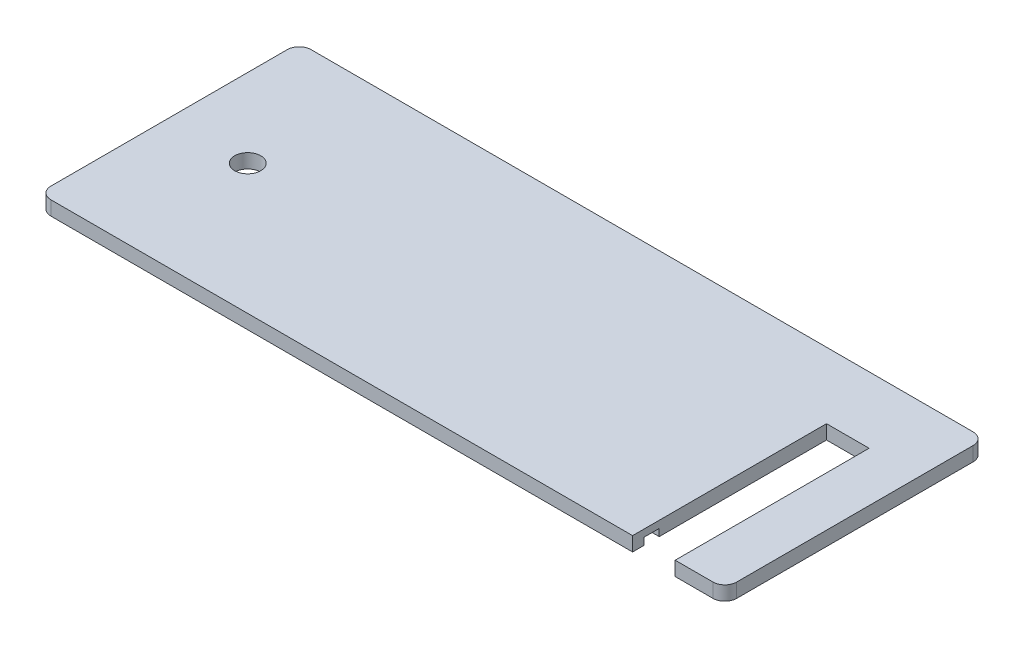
ISO-10303-21;
HEADER;
FILE_DESCRIPTION(('STEP AP214'),'2;1');
FILE_NAME('part.step','',(''),(''),'','','');
FILE_SCHEMA(('AUTOMOTIVE_DESIGN { 1 0 10303 214 1 1 1 1 }'));
ENDSEC;
DATA;
#1=APPLICATION_CONTEXT('core data for automotive mechanical design processes');
#2=APPLICATION_PROTOCOL_DEFINITION('international standard','automotive_design',2000,#1);
#3=PRODUCT_CONTEXT('',#1,'mechanical');
#4=PRODUCT('Part','Part','',(#3));
#5=PRODUCT_RELATED_PRODUCT_CATEGORY('part','',(#4));
#6=PRODUCT_DEFINITION_FORMATION('','',#4);
#7=PRODUCT_DEFINITION_CONTEXT('part definition',#1,'design');
#8=PRODUCT_DEFINITION('design','',#6,#7);
#9=PRODUCT_DEFINITION_SHAPE('','',#8);
#10=(LENGTH_UNIT() NAMED_UNIT(*) SI_UNIT(.MILLI.,.METRE.));
#11=(NAMED_UNIT(*) PLANE_ANGLE_UNIT() SI_UNIT($,.RADIAN.));
#12=(NAMED_UNIT(*) SI_UNIT($,.STERADIAN.) SOLID_ANGLE_UNIT());
#13=UNCERTAINTY_MEASURE_WITH_UNIT(LENGTH_MEASURE(1.E-05),#10,'distance_accuracy_value','');
#14=(GEOMETRIC_REPRESENTATION_CONTEXT(3) GLOBAL_UNCERTAINTY_ASSIGNED_CONTEXT((#13)) GLOBAL_UNIT_ASSIGNED_CONTEXT((#10,
#11,#12)) REPRESENTATION_CONTEXT('',''));
#15=CARTESIAN_POINT('',(0.,0.,0.));
#16=DIRECTION('',(0.,0.,1.));
#17=DIRECTION('',(1.,0.,0.));
#18=AXIS2_PLACEMENT_3D('',#15,#16,#17);
#19=CARTESIAN_POINT('',(5.88137084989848,3.,-5.8813708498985));
#20=DIRECTION('',(0.,1.,0.));
#21=DIRECTION('',(0.,0.,1.));
#22=AXIS2_PLACEMENT_3D('',#19,#20,#21);
#23=PLANE('',#22);
#24=DIRECTION('',(0.,0.,-1.));
#25=VECTOR('',#24,1.);
#26=CARTESIAN_POINT('',(11.25,3.,-98.8));
#27=LINE('',#26,#25);
#28=CARTESIAN_POINT('',(11.25,3.,-60.1961524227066));
#29=VERTEX_POINT('',#28);
#30=CARTESIAN_POINT('',(11.25,3.,-98.8));
#31=VERTEX_POINT('',#30);
#32=EDGE_CURVE('E592',#29,#31,#27,.T.);
#33=ORIENTED_EDGE('',*,*,#32,.F.);
#34=CARTESIAN_POINT('',(8.25,3.,-55.));
#35=DIRECTION('',(0.,1.,0.));
#36=DIRECTION('',(0.,0.,1.));
#37=AXIS2_PLACEMENT_3D('',#34,#35,#36);
#38=CIRCLE('',#37,6.);
#39=CARTESIAN_POINT('',(4.75,3.,-59.8733971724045));
#40=VERTEX_POINT('',#39);
#41=EDGE_CURVE('E305',#29,#40,#38,.T.);
#42=ORIENTED_EDGE('',*,*,#41,.T.);
#43=DIRECTION('',(0.,0.,-1.));
#44=VECTOR('',#43,1.);
#45=CARTESIAN_POINT('',(4.75,3.,-102.987258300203));
#46=LINE('',#45,#44);
#47=CARTESIAN_POINT('',(4.75,3.,-102.987258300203));
#48=VERTEX_POINT('',#47);
#49=EDGE_CURVE('E348',#40,#48,#46,.T.);
#50=ORIENTED_EDGE('',*,*,#49,.T.);
#51=CARTESIAN_POINT('',(5.88137084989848,3.,-104.118629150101));
#52=DIRECTION('',(0.,-1.,0.));
#53=DIRECTION('',(0.,0.,-1.));
#54=AXIS2_PLACEMENT_3D('',#51,#52,#53);
#55=CIRCLE('',#54,1.59999999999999);
#56=CARTESIAN_POINT('',(7.01274169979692,3.,-105.25));
#57=VERTEX_POINT('',#56);
#58=EDGE_CURVE('E353',#48,#57,#55,.T.);
#59=ORIENTED_EDGE('',*,*,#58,.T.);
#60=DIRECTION('',(1.,0.,0.));
#61=VECTOR('',#60,1.);
#62=CARTESIAN_POINT('',(7.01274169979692,3.,-105.25));
#63=LINE('',#62,#61);
#64=CARTESIAN_POINT('',(8.98725830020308,3.,-105.25));
#65=VERTEX_POINT('',#64);
#66=EDGE_CURVE('E356',#57,#65,#63,.T.);
#67=ORIENTED_EDGE('',*,*,#66,.T.);
#68=CARTESIAN_POINT('',(10.1186291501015,3.,-104.118629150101));
#69=DIRECTION('',(0.,-1.,0.));
#70=DIRECTION('',(0.,0.,1.));
#71=AXIS2_PLACEMENT_3D('',#68,#69,#70);
#72=CIRCLE('',#71,1.59999999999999);
#73=CARTESIAN_POINT('',(11.25,3.,-102.987258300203));
#74=VERTEX_POINT('',#73);
#75=EDGE_CURVE('E359',#65,#74,#72,.T.);
#76=ORIENTED_EDGE('',*,*,#75,.T.);
#77=DIRECTION('',(0.,0.,1.));
#78=VECTOR('',#77,1.);
#79=CARTESIAN_POINT('',(11.25,3.,-102.987258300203));
#80=LINE('',#79,#78);
#81=CARTESIAN_POINT('',(11.25,3.,-102.));
#82=VERTEX_POINT('',#81);
#83=EDGE_CURVE('E362',#74,#82,#80,.T.);
#84=ORIENTED_EDGE('',*,*,#83,.T.);
#85=DIRECTION('',(1.,0.,0.));
#86=VECTOR('',#85,1.);
#87=CARTESIAN_POINT('',(278.75,3.,-102.));
#88=LINE('',#87,#86);
#89=CARTESIAN_POINT('',(278.75,3.,-102.));
#90=VERTEX_POINT('',#89);
#91=EDGE_CURVE('E365',#82,#90,#88,.T.);
#92=ORIENTED_EDGE('',*,*,#91,.T.);
#93=DIRECTION('',(0.,0.,-1.));
#94=VECTOR('',#93,1.);
#95=CARTESIAN_POINT('',(278.75,3.,-102.987258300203));
#96=LINE('',#95,#94);
#97=CARTESIAN_POINT('',(278.75,3.,-102.987258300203));
#98=VERTEX_POINT('',#97);
#99=EDGE_CURVE('E368',#90,#98,#96,.T.);
#100=ORIENTED_EDGE('',*,*,#99,.T.);
#101=CARTESIAN_POINT('',(279.881370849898,3.,-104.118629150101));
#102=DIRECTION('',(0.,-1.,0.));
#103=DIRECTION('',(0.,0.,-1.));
#104=AXIS2_PLACEMENT_3D('',#101,#102,#103);
#105=CIRCLE('',#104,1.6);
#106=CARTESIAN_POINT('',(281.012741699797,3.,-105.25));
#107=VERTEX_POINT('',#106);
#108=EDGE_CURVE('E371',#98,#107,#105,.T.);
#109=ORIENTED_EDGE('',*,*,#108,.T.);
#110=DIRECTION('',(1.,0.,0.));
#111=VECTOR('',#110,1.);
#112=CARTESIAN_POINT('',(281.012741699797,3.,-105.25));
#113=LINE('',#112,#111);
#114=CARTESIAN_POINT('',(282.987258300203,3.,-105.25));
#115=VERTEX_POINT('',#114);
#116=EDGE_CURVE('E374',#107,#115,#113,.T.);
#117=ORIENTED_EDGE('',*,*,#116,.T.);
#118=CARTESIAN_POINT('',(284.118629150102,3.,-104.118629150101));
#119=DIRECTION('',(0.,-1.,0.));
#120=DIRECTION('',(0.,0.,1.));
#121=AXIS2_PLACEMENT_3D('',#118,#119,#120);
#122=CIRCLE('',#121,1.60000000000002);
#123=CARTESIAN_POINT('',(285.25,3.,-102.987258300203));
#124=VERTEX_POINT('',#123);
#125=EDGE_CURVE('E377',#115,#124,#122,.T.);
#126=ORIENTED_EDGE('',*,*,#125,.T.);
#127=DIRECTION('',(0.,0.,1.));
#128=VECTOR('',#127,1.);
#129=CARTESIAN_POINT('',(285.25,3.,-102.987258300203));
#130=LINE('',#129,#128);
#131=CARTESIAN_POINT('',(285.25,3.,-7.01274169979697));
#132=VERTEX_POINT('',#131);
#133=EDGE_CURVE('E380',#124,#132,#130,.T.);
#134=ORIENTED_EDGE('',*,*,#133,.T.);
#135=CARTESIAN_POINT('',(284.118629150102,3.,-5.8813708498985));
#136=DIRECTION('',(0.,-1.,0.));
#137=DIRECTION('',(0.,0.,-1.));
#138=AXIS2_PLACEMENT_3D('',#135,#136,#137);
#139=CIRCLE('',#138,1.60000000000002);
#140=CARTESIAN_POINT('',(282.987258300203,3.,-4.75));
#141=VERTEX_POINT('',#140);
#142=EDGE_CURVE('E383',#132,#141,#139,.T.);
#143=ORIENTED_EDGE('',*,*,#142,.T.);
#144=DIRECTION('',(-1.,0.,0.));
#145=VECTOR('',#144,1.);
#146=CARTESIAN_POINT('',(7.01274169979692,3.,-4.75));
#147=LINE('',#146,#145);
#148=CARTESIAN_POINT('',(269.,3.,-4.75));
#149=VERTEX_POINT('',#148);
#150=EDGE_CURVE('E387',#141,#149,#147,.T.);
#151=ORIENTED_EDGE('',*,*,#150,.T.);
#152=DIRECTION('',(0.,0.,1.));
#153=VECTOR('',#152,1.);
#154=CARTESIAN_POINT('',(269.,3.,0.));
#155=LINE('',#154,#153);
#156=CARTESIAN_POINT('',(269.,3.,-11.25));
#157=VERTEX_POINT('',#156);
#158=EDGE_CURVE('E568',#157,#149,#155,.T.);
#159=ORIENTED_EDGE('',*,*,#158,.F.);
#160=DIRECTION('',(-1.,0.,0.));
#161=VECTOR('',#160,1.);
#162=CARTESIAN_POINT('',(11.25,3.,-11.25));
#163=LINE('',#162,#161);
#164=CARTESIAN_POINT('',(278.75,3.,-11.25));
#165=VERTEX_POINT('',#164);
#166=EDGE_CURVE('E596',#165,#157,#163,.T.);
#167=ORIENTED_EDGE('',*,*,#166,.F.);
#168=DIRECTION('',(0.,0.,1.));
#169=VECTOR('',#168,1.);
#170=CARTESIAN_POINT('',(278.75,3.,-98.8));
#171=LINE('',#170,#169);
#172=CARTESIAN_POINT('',(278.75,3.,-98.8));
#173=VERTEX_POINT('',#172);
#174=EDGE_CURVE('E334',#173,#165,#171,.T.);
#175=ORIENTED_EDGE('',*,*,#174,.F.);
#176=DIRECTION('',(1.,0.,0.));
#177=VECTOR('',#176,1.);
#178=CARTESIAN_POINT('',(278.75,3.,-98.8));
#179=LINE('',#178,#177);
#180=EDGE_CURVE('E344',#31,#173,#179,.T.);
#181=ORIENTED_EDGE('',*,*,#180,.F.);
#182=EDGE_LOOP('',(#33,#42,#50,#59,#67,#76,#84,#92,#100,#109,#117,#126,#134,#143,#151,#159,#167,
#175,#181));
#183=FACE_BOUND('',#182,.T.);
#184=ADVANCED_FACE('F37',(#183),#23,.F.);
#185=CARTESIAN_POINT('',(4.75,3.,-102.987258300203));
#186=DIRECTION('',(-1.,0.,0.));
#187=DIRECTION('',(0.,0.,1.));
#188=AXIS2_PLACEMENT_3D('',#185,#186,#187);
#189=PLANE('',#188);
#190=ORIENTED_EDGE('',*,*,#49,.F.);
#191=DIRECTION('',(0.,-1.,0.));
#192=VECTOR('',#191,1.);
#193=CARTESIAN_POINT('',(4.75,3.5,-59.8733971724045));
#194=LINE('',#193,#192);
#195=CARTESIAN_POINT('',(4.75,0.,-59.8733971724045));
#196=VERTEX_POINT('',#195);
#197=EDGE_CURVE('E755',#40,#196,#194,.T.);
#198=ORIENTED_EDGE('',*,*,#197,.T.);
#199=DIRECTION('',(0.,0.,-1.));
#200=VECTOR('',#199,1.);
#201=CARTESIAN_POINT('',(4.75,0.,-102.987258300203));
#202=LINE('',#201,#200);
#203=CARTESIAN_POINT('',(4.75,0.,-102.987258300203));
#204=VERTEX_POINT('',#203);
#205=EDGE_CURVE('E394',#196,#204,#202,.T.);
#206=ORIENTED_EDGE('',*,*,#205,.T.);
#207=DIRECTION('',(0.,-1.,0.));
#208=VECTOR('',#207,1.);
#209=CARTESIAN_POINT('',(4.75,3.,-102.987258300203));
#210=LINE('',#209,#208);
#211=EDGE_CURVE('E460',#48,#204,#210,.T.);
#212=ORIENTED_EDGE('',*,*,#211,.F.);
#213=EDGE_LOOP('',(#190,#198,#206,#212));
#214=FACE_BOUND('',#213,.T.);
#215=ADVANCED_FACE('F721',(#214),#189,.F.);
#216=CARTESIAN_POINT('',(11.25,3.,-98.8));
#217=DIRECTION('',(-1.,0.,0.));
#218=DIRECTION('',(0.,0.,1.));
#219=AXIS2_PLACEMENT_3D('',#216,#217,#218);
#220=PLANE('',#219);
#221=DIRECTION('',(0.,-1.,0.));
#222=VECTOR('',#221,1.);
#223=CARTESIAN_POINT('',(11.25,3.5,-60.1961524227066));
#224=LINE('',#223,#222);
#225=CARTESIAN_POINT('',(11.25,0.,-60.1961524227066));
#226=VERTEX_POINT('',#225);
#227=EDGE_CURVE('E11',#29,#226,#224,.T.);
#228=ORIENTED_EDGE('',*,*,#227,.F.);
#229=ORIENTED_EDGE('',*,*,#32,.T.);
#230=DIRECTION('',(0.,-1.,0.));
#231=VECTOR('',#230,1.);
#232=CARTESIAN_POINT('',(11.25,3.,-98.8));
#233=LINE('',#232,#231);
#234=CARTESIAN_POINT('',(11.25,0.,-98.8));
#235=VERTEX_POINT('',#234);
#236=EDGE_CURVE('E322',#31,#235,#233,.T.);
#237=ORIENTED_EDGE('',*,*,#236,.T.);
#238=DIRECTION('',(0.,0.,-1.));
#239=VECTOR('',#238,1.);
#240=CARTESIAN_POINT('',(11.25,0.,-98.8));
#241=LINE('',#240,#239);
#242=EDGE_CURVE('E313',#226,#235,#241,.T.);
#243=ORIENTED_EDGE('',*,*,#242,.F.);
#244=EDGE_LOOP('',(#228,#229,#237,#243));
#245=FACE_BOUND('',#244,.T.);
#246=ADVANCED_FACE('F320',(#245),#220,.T.);
#247=CARTESIAN_POINT('',(7.01274169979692,3.,-4.75));
#248=DIRECTION('',(0.,0.,1.));
#249=DIRECTION('',(1.,0.,0.));
#250=AXIS2_PLACEMENT_3D('',#247,#248,#249);
#251=PLANE('',#250);
#252=CARTESIAN_POINT('',(229.803847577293,3.,-4.75));
#253=VERTEX_POINT('',#252);
#254=CARTESIAN_POINT('',(7.01274169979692,3.,-4.75));
#255=VERTEX_POINT('',#254);
#256=EDGE_CURVE('E386',#253,#255,#147,.T.);
#257=ORIENTED_EDGE('',*,*,#256,.F.);
#258=DIRECTION('',(0.,-1.,0.));
#259=VECTOR('',#258,1.);
#260=CARTESIAN_POINT('',(229.803847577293,3.5,-4.75));
#261=LINE('',#260,#259);
#262=CARTESIAN_POINT('',(229.803847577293,0.,-4.75));
#263=VERTEX_POINT('',#262);
#264=EDGE_CURVE('E664',#253,#263,#261,.T.);
#265=ORIENTED_EDGE('',*,*,#264,.T.);
#266=DIRECTION('',(-1.,0.,0.));
#267=VECTOR('',#266,1.);
#268=CARTESIAN_POINT('',(7.01274169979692,0.,-4.75));
#269=LINE('',#268,#267);
#270=CARTESIAN_POINT('',(7.01274169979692,0.,-4.75));
#271=VERTEX_POINT('',#270);
#272=EDGE_CURVE('E431',#263,#271,#269,.T.);
#273=ORIENTED_EDGE('',*,*,#272,.T.);
#274=DIRECTION('',(0.,-1.,0.));
#275=VECTOR('',#274,1.);
#276=CARTESIAN_POINT('',(7.01274169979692,3.,-4.75));
#277=LINE('',#276,#275);
#278=EDGE_CURVE('E434',#255,#271,#277,.T.);
#279=ORIENTED_EDGE('',*,*,#278,.F.);
#280=EDGE_LOOP('',(#257,#265,#273,#279));
#281=FACE_BOUND('',#280,.T.);
#282=ADVANCED_FACE('F714',(#281),#251,.F.);
#283=CARTESIAN_POINT('',(251.,3.,-4.75));
#284=VERTEX_POINT('',#283);
#285=CARTESIAN_POINT('',(240.196152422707,3.,-4.75));
#286=VERTEX_POINT('',#285);
#287=EDGE_CURVE('E391',#284,#286,#147,.T.);
#288=ORIENTED_EDGE('',*,*,#287,.T.);
#289=CARTESIAN_POINT('',(235.,3.,-7.75));
#290=DIRECTION('',(0.,1.,0.));
#291=DIRECTION('',(0.,0.,1.));
#292=AXIS2_PLACEMENT_3D('',#289,#290,#291);
#293=CIRCLE('',#292,6.00000000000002);
#294=CARTESIAN_POINT('',(239.873397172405,3.,-11.25));
#295=VERTEX_POINT('',#294);
#296=EDGE_CURVE('E652',#286,#295,#293,.T.);
#297=ORIENTED_EDGE('',*,*,#296,.T.);
#298=CARTESIAN_POINT('',(251.,3.,-11.25));
#299=VERTEX_POINT('',#298);
#300=EDGE_CURVE('E618',#299,#295,#163,.T.);
#301=ORIENTED_EDGE('',*,*,#300,.F.);
#302=DIRECTION('',(0.,0.,-1.));
#303=VECTOR('',#302,1.);
#304=CARTESIAN_POINT('',(251.,3.,0.));
#305=LINE('',#304,#303);
#306=EDGE_CURVE('E465',#284,#299,#305,.T.);
#307=ORIENTED_EDGE('',*,*,#306,.F.);
#308=EDGE_LOOP('',(#288,#297,#301,#307));
#309=FACE_BOUND('',#308,.T.);
#310=ADVANCED_FACE('F650',(#309),#23,.F.);
#311=CARTESIAN_POINT('',(11.25,3.,-11.25));
#312=DIRECTION('',(0.,0.,1.));
#313=DIRECTION('',(1.,0.,0.));
#314=AXIS2_PLACEMENT_3D('',#311,#312,#313);
#315=PLANE('',#314);
#316=DIRECTION('',(0.,-1.,0.));
#317=VECTOR('',#316,1.);
#318=CARTESIAN_POINT('',(230.126602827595,3.5,-11.25));
#319=LINE('',#318,#317);
#320=CARTESIAN_POINT('',(230.126602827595,3.,-11.25));
#321=VERTEX_POINT('',#320);
#322=CARTESIAN_POINT('',(230.126602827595,0.,-11.25));
#323=VERTEX_POINT('',#322);
#324=EDGE_CURVE('E576',#321,#323,#319,.T.);
#325=ORIENTED_EDGE('',*,*,#324,.F.);
#326=CARTESIAN_POINT('',(11.25,3.,-11.25));
#327=VERTEX_POINT('',#326);
#328=EDGE_CURVE('E615',#321,#327,#163,.T.);
#329=ORIENTED_EDGE('',*,*,#328,.T.);
#330=DIRECTION('',(0.,-1.,0.));
#331=VECTOR('',#330,1.);
#332=CARTESIAN_POINT('',(11.25,3.,-11.25));
#333=LINE('',#332,#331);
#334=CARTESIAN_POINT('',(11.25,0.,-11.25));
#335=VERTEX_POINT('',#334);
#336=EDGE_CURVE('E339',#327,#335,#333,.T.);
#337=ORIENTED_EDGE('',*,*,#336,.T.);
#338=DIRECTION('',(-1.,0.,0.));
#339=VECTOR('',#338,1.);
#340=CARTESIAN_POINT('',(11.25,0.,-11.25));
#341=LINE('',#340,#339);
#342=EDGE_CURVE('E330',#323,#335,#341,.T.);
#343=ORIENTED_EDGE('',*,*,#342,.F.);
#344=EDGE_LOOP('',(#325,#329,#337,#343));
#345=FACE_BOUND('',#344,.T.);
#346=ADVANCED_FACE('F693',(#345),#315,.T.);
#347=CARTESIAN_POINT('',(285.,0.,-5.));
#348=DIRECTION('',(0.,1.,0.));
#349=DIRECTION('',(0.,0.,1.));
#350=AXIS2_PLACEMENT_3D('',#347,#348,#349);
#351=PLANE('',#350);
#352=CARTESIAN_POINT('',(41.25,0.,-66.));
#353=DIRECTION('',(0.,-1.,0.));
#354=DIRECTION('',(0.,0.,1.));
#355=AXIS2_PLACEMENT_3D('',#352,#353,#354);
#356=CIRCLE('',#355,1.1);
#357=CARTESIAN_POINT('',(41.25,0.,-64.9));
#358=VERTEX_POINT('',#357);
#359=EDGE_CURVE('E667',#358,#358,#356,.T.);
#360=ORIENTED_EDGE('',*,*,#359,.F.);
#361=EDGE_LOOP('',(#360));
#362=FACE_BOUND('',#361,.T.);
#363=CARTESIAN_POINT('',(87.25,0.,-66.));
#364=DIRECTION('',(0.,-1.,0.));
#365=DIRECTION('',(0.,0.,1.));
#366=AXIS2_PLACEMENT_3D('',#363,#364,#365);
#367=CIRCLE('',#366,1.10000000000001);
#368=CARTESIAN_POINT('',(87.25,0.,-64.9));
#369=VERTEX_POINT('',#368);
#370=EDGE_CURVE('E676',#369,#369,#367,.T.);
#371=ORIENTED_EDGE('',*,*,#370,.F.);
#372=EDGE_LOOP('',(#371));
#373=FACE_BOUND('',#372,.T.);
#374=CARTESIAN_POINT('',(87.25,0.,-44.));
#375=DIRECTION('',(0.,-1.,0.));
#376=DIRECTION('',(0.,0.,-1.));
#377=AXIS2_PLACEMENT_3D('',#374,#375,#376);
#378=CIRCLE('',#377,1.10000000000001);
#379=CARTESIAN_POINT('',(87.25,0.,-45.1));
#380=VERTEX_POINT('',#379);
#381=EDGE_CURVE('E612',#380,#380,#378,.T.);
#382=ORIENTED_EDGE('',*,*,#381,.F.);
#383=EDGE_LOOP('',(#382));
#384=FACE_BOUND('',#383,.T.);
#385=CARTESIAN_POINT('',(41.25,0.,-44.));
#386=DIRECTION('',(0.,-1.,0.));
#387=DIRECTION('',(0.,0.,-1.));
#388=AXIS2_PLACEMENT_3D('',#385,#386,#387);
#389=CIRCLE('',#388,1.1);
#390=CARTESIAN_POINT('',(41.25,0.,-45.1));
#391=VERTEX_POINT('',#390);
#392=EDGE_CURVE('E604',#391,#391,#389,.T.);
#393=ORIENTED_EDGE('',*,*,#392,.F.);
#394=EDGE_LOOP('',(#393));
#395=FACE_BOUND('',#394,.T.);
#396=CARTESIAN_POINT('',(33.25,0.,-55.));
#397=DIRECTION('',(0.,1.,0.));
#398=DIRECTION('',(0.,0.,1.));
#399=AXIS2_PLACEMENT_3D('',#396,#397,#398);
#400=CIRCLE('',#399,5.5);
#401=CARTESIAN_POINT('',(33.25,0.,-49.5));
#402=VERTEX_POINT('',#401);
#403=EDGE_CURVE('E471',#402,#402,#400,.T.);
#404=ORIENTED_EDGE('',*,*,#403,.T.);
#405=EDGE_LOOP('',(#404));
#406=FACE_BOUND('',#405,.T.);
#407=CARTESIAN_POINT('',(11.25,0.,-49.8038475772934));
#408=VERTEX_POINT('',#407);
#409=EDGE_CURVE('E316',#335,#408,#241,.T.);
#410=ORIENTED_EDGE('',*,*,#409,.T.);
#411=CARTESIAN_POINT('',(8.25,0.,-55.));
#412=DIRECTION('',(0.,-1.,0.));
#413=DIRECTION('',(0.,0.,-1.));
#414=AXIS2_PLACEMENT_3D('',#411,#412,#413);
#415=CIRCLE('',#414,6.);
#416=EDGE_CURVE('E51',#226,#408,#415,.T.);
#417=ORIENTED_EDGE('',*,*,#416,.F.);
#418=ORIENTED_EDGE('',*,*,#242,.T.);
#419=DIRECTION('',(1.,0.,0.));
#420=VECTOR('',#419,1.);
#421=CARTESIAN_POINT('',(278.75,0.,-98.8));
#422=LINE('',#421,#420);
#423=CARTESIAN_POINT('',(278.75,0.,-98.8));
#424=VERTEX_POINT('',#423);
#425=EDGE_CURVE('E326',#235,#424,#422,.T.);
#426=ORIENTED_EDGE('',*,*,#425,.T.);
#427=DIRECTION('',(0.,0.,1.));
#428=VECTOR('',#427,1.);
#429=CARTESIAN_POINT('',(278.75,0.,-98.8));
#430=LINE('',#429,#428);
#431=CARTESIAN_POINT('',(278.75,0.,-11.25));
#432=VERTEX_POINT('',#431);
#433=EDGE_CURVE('E599',#424,#432,#430,.T.);
#434=ORIENTED_EDGE('',*,*,#433,.T.);
#435=CARTESIAN_POINT('',(269.,0.,-11.25));
#436=VERTEX_POINT('',#435);
#437=EDGE_CURVE('E324',#432,#436,#341,.T.);
#438=ORIENTED_EDGE('',*,*,#437,.T.);
#439=DIRECTION('',(0.,0.,1.));
#440=VECTOR('',#439,1.);
#441=CARTESIAN_POINT('',(269.,0.,0.));
#442=LINE('',#441,#440);
#443=CARTESIAN_POINT('',(269.,0.,-82.));
#444=VERTEX_POINT('',#443);
#445=EDGE_CURVE('E511',#444,#436,#442,.T.);
#446=ORIENTED_EDGE('',*,*,#445,.F.);
#447=DIRECTION('',(1.,0.,0.));
#448=VECTOR('',#447,1.);
#449=CARTESIAN_POINT('',(251.,0.,-82.));
#450=LINE('',#449,#448);
#451=CARTESIAN_POINT('',(251.,0.,-82.));
#452=VERTEX_POINT('',#451);
#453=EDGE_CURVE('E508',#452,#444,#450,.T.);
#454=ORIENTED_EDGE('',*,*,#453,.F.);
#455=DIRECTION('',(0.,0.,-1.));
#456=VECTOR('',#455,1.);
#457=CARTESIAN_POINT('',(251.,0.,0.));
#458=LINE('',#457,#456);
#459=CARTESIAN_POINT('',(251.,0.,-11.25));
#460=VERTEX_POINT('',#459);
#461=EDGE_CURVE('E475',#460,#452,#458,.T.);
#462=ORIENTED_EDGE('',*,*,#461,.F.);
#463=CARTESIAN_POINT('',(239.873397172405,0.,-11.25));
#464=VERTEX_POINT('',#463);
#465=EDGE_CURVE('E328',#460,#464,#341,.T.);
#466=ORIENTED_EDGE('',*,*,#465,.T.);
#467=CARTESIAN_POINT('',(235.,0.,-7.75));
#468=DIRECTION('',(0.,-1.,0.));
#469=DIRECTION('',(0.,0.,-1.));
#470=AXIS2_PLACEMENT_3D('',#467,#468,#469);
#471=CIRCLE('',#470,6.00000000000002);
#472=EDGE_CURVE('E59',#323,#464,#471,.T.);
#473=ORIENTED_EDGE('',*,*,#472,.F.);
#474=ORIENTED_EDGE('',*,*,#342,.T.);
#475=EDGE_LOOP('',(#410,#417,#418,#426,#434,#438,#446,#454,#462,#466,#473,#474));
#476=FACE_BOUND('',#475,.T.);
#477=ADVANCED_FACE('F311',(#362,#373,#384,#395,#406,#476),#351,.F.);
#478=CARTESIAN_POINT('',(285.,6.,-5.));
#479=DIRECTION('',(0.,1.,0.));
#480=DIRECTION('',(0.,0.,1.));
#481=AXIS2_PLACEMENT_3D('',#478,#479,#480);
#482=PLANE('',#481);
#483=DIRECTION('',(0.,0.,-1.));
#484=VECTOR('',#483,1.);
#485=CARTESIAN_POINT('',(251.,6.,0.));
#486=LINE('',#485,#484);
#487=CARTESIAN_POINT('',(251.,6.,0.));
#488=VERTEX_POINT('',#487);
#489=CARTESIAN_POINT('',(251.,6.,-82.));
#490=VERTEX_POINT('',#489);
#491=EDGE_CURVE('E478',#488,#490,#486,.T.);
#492=ORIENTED_EDGE('',*,*,#491,.T.);
#493=DIRECTION('',(1.,0.,0.));
#494=VECTOR('',#493,1.);
#495=CARTESIAN_POINT('',(251.,6.,-82.));
#496=LINE('',#495,#494);
#497=CARTESIAN_POINT('',(269.,6.,-82.));
#498=VERTEX_POINT('',#497);
#499=EDGE_CURVE('E481',#490,#498,#496,.T.);
#500=ORIENTED_EDGE('',*,*,#499,.T.);
#501=DIRECTION('',(0.,0.,1.));
#502=VECTOR('',#501,1.);
#503=CARTESIAN_POINT('',(269.,6.,0.));
#504=LINE('',#503,#502);
#505=CARTESIAN_POINT('',(269.,6.,0.));
#506=VERTEX_POINT('',#505);
#507=EDGE_CURVE('E484',#498,#506,#504,.T.);
#508=ORIENTED_EDGE('',*,*,#507,.T.);
#509=DIRECTION('',(1.,0.,0.));
#510=VECTOR('',#509,1.);
#511=CARTESIAN_POINT('',(269.,6.,0.));
#512=LINE('',#511,#510);
#513=CARTESIAN_POINT('',(285.,6.,0.));
#514=VERTEX_POINT('',#513);
#515=EDGE_CURVE('E486',#506,#514,#512,.T.);
#516=ORIENTED_EDGE('',*,*,#515,.T.);
#517=CARTESIAN_POINT('',(285.,6.,-5.));
#518=DIRECTION('',(0.,1.,0.));
#519=DIRECTION('',(0.,0.,1.));
#520=AXIS2_PLACEMENT_3D('',#517,#518,#519);
#521=CIRCLE('',#520,5.);
#522=CARTESIAN_POINT('',(290.,6.,-5.00000000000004));
#523=VERTEX_POINT('',#522);
#524=EDGE_CURVE('E488',#514,#523,#521,.T.);
#525=ORIENTED_EDGE('',*,*,#524,.T.);
#526=DIRECTION('',(0.,0.,-1.));
#527=VECTOR('',#526,1.);
#528=CARTESIAN_POINT('',(290.,6.,-5.00000000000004));
#529=LINE('',#528,#527);
#530=CARTESIAN_POINT('',(290.,6.,-105.));
#531=VERTEX_POINT('',#530);
#532=EDGE_CURVE('E490',#523,#531,#529,.T.);
#533=ORIENTED_EDGE('',*,*,#532,.T.);
#534=CARTESIAN_POINT('',(285.,6.,-105.));
#535=DIRECTION('',(0.,1.,0.));
#536=DIRECTION('',(0.,0.,-1.));
#537=AXIS2_PLACEMENT_3D('',#534,#535,#536);
#538=CIRCLE('',#537,5.);
#539=CARTESIAN_POINT('',(285.,6.,-110.));
#540=VERTEX_POINT('',#539);
#541=EDGE_CURVE('E492',#531,#540,#538,.T.);
#542=ORIENTED_EDGE('',*,*,#541,.T.);
#543=DIRECTION('',(-1.,0.,0.));
#544=VECTOR('',#543,1.);
#545=CARTESIAN_POINT('',(5.00000000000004,6.,-110.));
#546=LINE('',#545,#544);
#547=CARTESIAN_POINT('',(5.00000000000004,6.,-110.));
#548=VERTEX_POINT('',#547);
#549=EDGE_CURVE('E494',#540,#548,#546,.T.);
#550=ORIENTED_EDGE('',*,*,#549,.T.);
#551=CARTESIAN_POINT('',(5.,6.,-105.));
#552=DIRECTION('',(0.,1.,0.));
#553=DIRECTION('',(0.,0.,-1.));
#554=AXIS2_PLACEMENT_3D('',#551,#552,#553);
#555=CIRCLE('',#554,5.);
#556=CARTESIAN_POINT('',(0.,6.,-105.));
#557=VERTEX_POINT('',#556);
#558=EDGE_CURVE('E496',#548,#557,#555,.T.);
#559=ORIENTED_EDGE('',*,*,#558,.T.);
#560=DIRECTION('',(0.,0.,1.));
#561=VECTOR('',#560,1.);
#562=CARTESIAN_POINT('',(0.,6.,-5.00000000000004));
#563=LINE('',#562,#561);
#564=CARTESIAN_POINT('',(0.,6.,-5.00000000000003));
#565=VERTEX_POINT('',#564);
#566=EDGE_CURVE('E498',#557,#565,#563,.T.);
#567=ORIENTED_EDGE('',*,*,#566,.T.);
#568=CARTESIAN_POINT('',(5.,6.,-5.));
#569=DIRECTION('',(0.,1.,0.));
#570=DIRECTION('',(0.,0.,-1.));
#571=AXIS2_PLACEMENT_3D('',#568,#569,#570);
#572=CIRCLE('',#571,5.);
#573=CARTESIAN_POINT('',(5.00000000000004,6.,0.));
#574=VERTEX_POINT('',#573);
#575=EDGE_CURVE('E500',#565,#574,#572,.T.);
#576=ORIENTED_EDGE('',*,*,#575,.T.);
#577=DIRECTION('',(1.,0.,0.));
#578=VECTOR('',#577,1.);
#579=CARTESIAN_POINT('',(5.00000000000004,6.,0.));
#580=LINE('',#579,#578);
#581=EDGE_CURVE('E502',#574,#488,#580,.T.);
#582=ORIENTED_EDGE('',*,*,#581,.T.);
#583=EDGE_LOOP('',(#492,#500,#508,#516,#525,#533,#542,#550,#559,#567,#576,#582));
#584=FACE_BOUND('',#583,.T.);
#585=CARTESIAN_POINT('',(33.25,6.,-55.));
#586=DIRECTION('',(0.,1.,0.));
#587=DIRECTION('',(0.,0.,1.));
#588=AXIS2_PLACEMENT_3D('',#585,#586,#587);
#589=CIRCLE('',#588,5.5);
#590=CARTESIAN_POINT('',(33.25,6.,-49.5));
#591=VERTEX_POINT('',#590);
#592=EDGE_CURVE('E472',#591,#591,#589,.T.);
#593=ORIENTED_EDGE('',*,*,#592,.F.);
#594=EDGE_LOOP('',(#593));
#595=FACE_BOUND('',#594,.T.);
#596=ADVANCED_FACE('F692',(#584,#595),#482,.T.);
#597=ORIENTED_EDGE('',*,*,#205,.F.);
#598=CARTESIAN_POINT('',(4.75,0.,-50.1266028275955));
#599=VERTEX_POINT('',#598);
#600=EDGE_CURVE('E318',#599,#196,#415,.T.);
#601=ORIENTED_EDGE('',*,*,#600,.F.);
#602=CARTESIAN_POINT('',(4.75,0.,-7.01274169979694));
#603=VERTEX_POINT('',#602);
#604=EDGE_CURVE('E395',#603,#599,#202,.T.);
#605=ORIENTED_EDGE('',*,*,#604,.F.);
#606=CARTESIAN_POINT('',(5.88137084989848,0.,-5.8813708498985));
#607=DIRECTION('',(0.,-1.,0.));
#608=DIRECTION('',(0.,0.,1.));
#609=AXIS2_PLACEMENT_3D('',#606,#607,#608);
#610=CIRCLE('',#609,1.59999999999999);
#611=EDGE_CURVE('E337',#271,#603,#610,.T.);
#612=ORIENTED_EDGE('',*,*,#611,.F.);
#613=ORIENTED_EDGE('',*,*,#272,.F.);
#614=CARTESIAN_POINT('',(240.196152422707,0.,-4.75));
#615=VERTEX_POINT('',#614);
#616=EDGE_CURVE('E660',#615,#263,#471,.T.);
#617=ORIENTED_EDGE('',*,*,#616,.F.);
#618=CARTESIAN_POINT('',(251.,0.,-4.75));
#619=VERTEX_POINT('',#618);
#620=EDGE_CURVE('E433',#619,#615,#269,.T.);
#621=ORIENTED_EDGE('',*,*,#620,.F.);
#622=CARTESIAN_POINT('',(251.,0.,0.));
#623=VERTEX_POINT('',#622);
#624=EDGE_CURVE('E505',#623,#619,#458,.T.);
#625=ORIENTED_EDGE('',*,*,#624,.F.);
#626=DIRECTION('',(1.,0.,0.));
#627=VECTOR('',#626,1.);
#628=CARTESIAN_POINT('',(5.00000000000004,0.,0.));
#629=LINE('',#628,#627);
#630=CARTESIAN_POINT('',(5.00000000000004,0.,0.));
#631=VERTEX_POINT('',#630);
#632=EDGE_CURVE('E482',#631,#623,#629,.T.);
#633=ORIENTED_EDGE('',*,*,#632,.F.);
#634=CARTESIAN_POINT('',(5.,0.,-5.));
#635=DIRECTION('',(0.,1.,0.));
#636=DIRECTION('',(0.,0.,-1.));
#637=AXIS2_PLACEMENT_3D('',#634,#635,#636);
#638=CIRCLE('',#637,5.);
#639=CARTESIAN_POINT('',(0.,0.,-5.00000000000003));
#640=VERTEX_POINT('',#639);
#641=EDGE_CURVE('E528',#640,#631,#638,.T.);
#642=ORIENTED_EDGE('',*,*,#641,.F.);
#643=DIRECTION('',(0.,0.,1.));
#644=VECTOR('',#643,1.);
#645=CARTESIAN_POINT('',(0.,0.,-5.00000000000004));
#646=LINE('',#645,#644);
#647=CARTESIAN_POINT('',(0.,0.,-105.));
#648=VERTEX_POINT('',#647);
#649=EDGE_CURVE('E526',#648,#640,#646,.T.);
#650=ORIENTED_EDGE('',*,*,#649,.F.);
#651=CARTESIAN_POINT('',(5.,0.,-105.));
#652=DIRECTION('',(0.,1.,0.));
#653=DIRECTION('',(0.,0.,-1.));
#654=AXIS2_PLACEMENT_3D('',#651,#652,#653);
#655=CIRCLE('',#654,5.);
#656=CARTESIAN_POINT('',(5.00000000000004,0.,-110.));
#657=VERTEX_POINT('',#656);
#658=EDGE_CURVE('E524',#657,#648,#655,.T.);
#659=ORIENTED_EDGE('',*,*,#658,.F.);
#660=DIRECTION('',(-1.,0.,0.));
#661=VECTOR('',#660,1.);
#662=CARTESIAN_POINT('',(5.00000000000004,0.,-110.));
#663=LINE('',#662,#661);
#664=CARTESIAN_POINT('',(285.,0.,-110.));
#665=VERTEX_POINT('',#664);
#666=EDGE_CURVE('E522',#665,#657,#663,.T.);
#667=ORIENTED_EDGE('',*,*,#666,.F.);
#668=CARTESIAN_POINT('',(285.,0.,-105.));
#669=DIRECTION('',(0.,1.,0.));
#670=DIRECTION('',(0.,0.,-1.));
#671=AXIS2_PLACEMENT_3D('',#668,#669,#670);
#672=CIRCLE('',#671,5.);
#673=CARTESIAN_POINT('',(290.,0.,-105.));
#674=VERTEX_POINT('',#673);
#675=EDGE_CURVE('E520',#674,#665,#672,.T.);
#676=ORIENTED_EDGE('',*,*,#675,.F.);
#677=DIRECTION('',(0.,0.,-1.));
#678=VECTOR('',#677,1.);
#679=CARTESIAN_POINT('',(290.,0.,-5.00000000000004));
#680=LINE('',#679,#678);
#681=CARTESIAN_POINT('',(290.,0.,-5.00000000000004));
#682=VERTEX_POINT('',#681);
#683=EDGE_CURVE('E518',#682,#674,#680,.T.);
#684=ORIENTED_EDGE('',*,*,#683,.F.);
#685=CARTESIAN_POINT('',(285.,0.,-5.));
#686=DIRECTION('',(0.,1.,0.));
#687=DIRECTION('',(0.,0.,1.));
#688=AXIS2_PLACEMENT_3D('',#685,#686,#687);
#689=CIRCLE('',#688,5.);
#690=CARTESIAN_POINT('',(285.,0.,0.));
#691=VERTEX_POINT('',#690);
#692=EDGE_CURVE('E516',#691,#682,#689,.T.);
#693=ORIENTED_EDGE('',*,*,#692,.F.);
#694=DIRECTION('',(1.,0.,0.));
#695=VECTOR('',#694,1.);
#696=CARTESIAN_POINT('',(269.,0.,0.));
#697=LINE('',#696,#695);
#698=CARTESIAN_POINT('',(269.,0.,0.));
#699=VERTEX_POINT('',#698);
#700=EDGE_CURVE('E514',#699,#691,#697,.T.);
#701=ORIENTED_EDGE('',*,*,#700,.F.);
#702=CARTESIAN_POINT('',(269.,0.,-4.75));
#703=VERTEX_POINT('',#702);
#704=EDGE_CURVE('E510',#703,#699,#442,.T.);
#705=ORIENTED_EDGE('',*,*,#704,.F.);
#706=CARTESIAN_POINT('',(282.987258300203,0.,-4.75));
#707=VERTEX_POINT('',#706);
#708=EDGE_CURVE('E349',#707,#703,#269,.T.);
#709=ORIENTED_EDGE('',*,*,#708,.F.);
#710=CARTESIAN_POINT('',(284.118629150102,0.,-5.8813708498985));
#711=DIRECTION('',(0.,-1.,0.));
#712=DIRECTION('',(0.,0.,-1.));
#713=AXIS2_PLACEMENT_3D('',#710,#711,#712);
#714=CIRCLE('',#713,1.60000000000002);
#715=CARTESIAN_POINT('',(285.25,0.,-7.01274169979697));
#716=VERTEX_POINT('',#715);
#717=EDGE_CURVE('E428',#716,#707,#714,.T.);
#718=ORIENTED_EDGE('',*,*,#717,.F.);
#719=DIRECTION('',(0.,0.,1.));
#720=VECTOR('',#719,1.);
#721=CARTESIAN_POINT('',(285.25,0.,-102.987258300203));
#722=LINE('',#721,#720);
#723=CARTESIAN_POINT('',(285.25,0.,-102.987258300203));
#724=VERTEX_POINT('',#723);
#725=EDGE_CURVE('E425',#724,#716,#722,.T.);
#726=ORIENTED_EDGE('',*,*,#725,.F.);
#727=CARTESIAN_POINT('',(284.118629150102,0.,-104.118629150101));
#728=DIRECTION('',(0.,-1.,0.));
#729=DIRECTION('',(0.,0.,1.));
#730=AXIS2_PLACEMENT_3D('',#727,#728,#729);
#731=CIRCLE('',#730,1.60000000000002);
#732=CARTESIAN_POINT('',(282.987258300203,0.,-105.25));
#733=VERTEX_POINT('',#732);
#734=EDGE_CURVE('E422',#733,#724,#731,.T.);
#735=ORIENTED_EDGE('',*,*,#734,.F.);
#736=DIRECTION('',(1.,0.,0.));
#737=VECTOR('',#736,1.);
#738=CARTESIAN_POINT('',(281.012741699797,0.,-105.25));
#739=LINE('',#738,#737);
#740=CARTESIAN_POINT('',(281.012741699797,0.,-105.25));
#741=VERTEX_POINT('',#740);
#742=EDGE_CURVE('E419',#741,#733,#739,.T.);
#743=ORIENTED_EDGE('',*,*,#742,.F.);
#744=CARTESIAN_POINT('',(279.881370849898,0.,-104.118629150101));
#745=DIRECTION('',(0.,-1.,0.));
#746=DIRECTION('',(0.,0.,-1.));
#747=AXIS2_PLACEMENT_3D('',#744,#745,#746);
#748=CIRCLE('',#747,1.6);
#749=CARTESIAN_POINT('',(278.75,0.,-102.987258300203));
#750=VERTEX_POINT('',#749);
#751=EDGE_CURVE('E416',#750,#741,#748,.T.);
#752=ORIENTED_EDGE('',*,*,#751,.F.);
#753=DIRECTION('',(0.,0.,-1.));
#754=VECTOR('',#753,1.);
#755=CARTESIAN_POINT('',(278.75,0.,-102.987258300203));
#756=LINE('',#755,#754);
#757=CARTESIAN_POINT('',(278.75,0.,-102.));
#758=VERTEX_POINT('',#757);
#759=EDGE_CURVE('E413',#758,#750,#756,.T.);
#760=ORIENTED_EDGE('',*,*,#759,.F.);
#761=DIRECTION('',(1.,0.,0.));
#762=VECTOR('',#761,1.);
#763=CARTESIAN_POINT('',(278.75,0.,-102.));
#764=LINE('',#763,#762);
#765=CARTESIAN_POINT('',(11.25,0.,-102.));
#766=VERTEX_POINT('',#765);
#767=EDGE_CURVE('E410',#766,#758,#764,.T.);
#768=ORIENTED_EDGE('',*,*,#767,.F.);
#769=DIRECTION('',(0.,0.,1.));
#770=VECTOR('',#769,1.);
#771=CARTESIAN_POINT('',(11.25,0.,-102.987258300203));
#772=LINE('',#771,#770);
#773=CARTESIAN_POINT('',(11.25,0.,-102.987258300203));
#774=VERTEX_POINT('',#773);
#775=EDGE_CURVE('E407',#774,#766,#772,.T.);
#776=ORIENTED_EDGE('',*,*,#775,.F.);
#777=CARTESIAN_POINT('',(10.1186291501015,0.,-104.118629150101));
#778=DIRECTION('',(0.,-1.,0.));
#779=DIRECTION('',(0.,0.,1.));
#780=AXIS2_PLACEMENT_3D('',#777,#778,#779);
#781=CIRCLE('',#780,1.59999999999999);
#782=CARTESIAN_POINT('',(8.98725830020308,0.,-105.25));
#783=VERTEX_POINT('',#782);
#784=EDGE_CURVE('E404',#783,#774,#781,.T.);
#785=ORIENTED_EDGE('',*,*,#784,.F.);
#786=DIRECTION('',(1.,0.,0.));
#787=VECTOR('',#786,1.);
#788=CARTESIAN_POINT('',(7.01274169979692,0.,-105.25));
#789=LINE('',#788,#787);
#790=CARTESIAN_POINT('',(7.01274169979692,0.,-105.25));
#791=VERTEX_POINT('',#790);
#792=EDGE_CURVE('E401',#791,#783,#789,.T.);
#793=ORIENTED_EDGE('',*,*,#792,.F.);
#794=CARTESIAN_POINT('',(5.88137084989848,0.,-104.118629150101));
#795=DIRECTION('',(0.,-1.,0.));
#796=DIRECTION('',(0.,0.,-1.));
#797=AXIS2_PLACEMENT_3D('',#794,#795,#796);
#798=CIRCLE('',#797,1.59999999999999);
#799=EDGE_CURVE('E398',#204,#791,#798,.T.);
#800=ORIENTED_EDGE('',*,*,#799,.F.);
#801=EDGE_LOOP('',(#597,#601,#605,#612,#613,#617,#621,#625,#633,#642,#650,#659,#667,#676,#684,
#693,#701,#705,#709,#718,#726,#735,#743,#752,#760,#768,#776,#785,#793,#800));
#802=FACE_BOUND('',#801,.T.);
#803=ADVANCED_FACE('F696',(#802),#351,.F.);
#804=CARTESIAN_POINT('',(251.,6.,0.));
#805=DIRECTION('',(-1.,0.,0.));
#806=DIRECTION('',(0.,0.,1.));
#807=AXIS2_PLACEMENT_3D('',#804,#805,#806);
#808=PLANE('',#807);
#809=ORIENTED_EDGE('',*,*,#624,.T.);
#810=DIRECTION('',(0.,1.,0.));
#811=VECTOR('',#810,1.);
#812=CARTESIAN_POINT('',(251.,6.,-4.75));
#813=LINE('',#812,#811);
#814=EDGE_CURVE('E468',#619,#284,#813,.T.);
#815=ORIENTED_EDGE('',*,*,#814,.T.);
#816=ORIENTED_EDGE('',*,*,#306,.T.);
#817=DIRECTION('',(0.,1.,0.));
#818=VECTOR('',#817,1.);
#819=CARTESIAN_POINT('',(251.,6.,-11.25));
#820=LINE('',#819,#818);
#821=EDGE_CURVE('E437',#460,#299,#820,.T.);
#822=ORIENTED_EDGE('',*,*,#821,.F.);
#823=ORIENTED_EDGE('',*,*,#461,.T.);
#824=DIRECTION('',(0.,-1.,0.));
#825=VECTOR('',#824,1.);
#826=CARTESIAN_POINT('',(251.,6.,-82.));
#827=LINE('',#826,#825);
#828=EDGE_CURVE('E563',#490,#452,#827,.T.);
#829=ORIENTED_EDGE('',*,*,#828,.F.);
#830=ORIENTED_EDGE('',*,*,#491,.F.);
#831=DIRECTION('',(0.,-1.,0.));
#832=VECTOR('',#831,1.);
#833=CARTESIAN_POINT('',(251.,6.,0.));
#834=LINE('',#833,#832);
#835=EDGE_CURVE('E504',#488,#623,#834,.T.);
#836=ORIENTED_EDGE('',*,*,#835,.T.);
#837=EDGE_LOOP('',(#809,#815,#816,#822,#823,#829,#830,#836));
#838=FACE_BOUND('',#837,.T.);
#839=ADVANCED_FACE('F39',(#838),#808,.F.);
#840=CARTESIAN_POINT('',(251.,6.,-82.));
#841=DIRECTION('',(0.,0.,-1.));
#842=DIRECTION('',(-1.,0.,0.));
#843=AXIS2_PLACEMENT_3D('',#840,#841,#842);
#844=PLANE('',#843);
#845=ORIENTED_EDGE('',*,*,#453,.T.);
#846=DIRECTION('',(0.,-1.,0.));
#847=VECTOR('',#846,1.);
#848=CARTESIAN_POINT('',(269.,6.,-82.));
#849=LINE('',#848,#847);
#850=EDGE_CURVE('E560',#498,#444,#849,.T.);
#851=ORIENTED_EDGE('',*,*,#850,.F.);
#852=ORIENTED_EDGE('',*,*,#499,.F.);
#853=ORIENTED_EDGE('',*,*,#828,.T.);
#854=EDGE_LOOP('',(#845,#851,#852,#853));
#855=FACE_BOUND('',#854,.T.);
#856=ADVANCED_FACE('F640',(#855),#844,.F.);
#857=CARTESIAN_POINT('',(269.,6.,0.));
#858=DIRECTION('',(1.,0.,0.));
#859=DIRECTION('',(0.,0.,-1.));
#860=AXIS2_PLACEMENT_3D('',#857,#858,#859);
#861=PLANE('',#860);
#862=ORIENTED_EDGE('',*,*,#158,.T.);
#863=DIRECTION('',(0.,-1.,0.));
#864=VECTOR('',#863,1.);
#865=CARTESIAN_POINT('',(269.,6.,-4.75));
#866=LINE('',#865,#864);
#867=EDGE_CURVE('E571',#149,#703,#866,.T.);
#868=ORIENTED_EDGE('',*,*,#867,.T.);
#869=ORIENTED_EDGE('',*,*,#704,.T.);
#870=DIRECTION('',(0.,-1.,0.));
#871=VECTOR('',#870,1.);
#872=CARTESIAN_POINT('',(269.,6.,0.));
#873=LINE('',#872,#871);
#874=EDGE_CURVE('E557',#506,#699,#873,.T.);
#875=ORIENTED_EDGE('',*,*,#874,.F.);
#876=ORIENTED_EDGE('',*,*,#507,.F.);
#877=ORIENTED_EDGE('',*,*,#850,.T.);
#878=ORIENTED_EDGE('',*,*,#445,.T.);
#879=DIRECTION('',(0.,-1.,0.));
#880=VECTOR('',#879,1.);
#881=CARTESIAN_POINT('',(269.,6.,-11.25));
#882=LINE('',#881,#880);
#883=EDGE_CURVE('E566',#157,#436,#882,.T.);
#884=ORIENTED_EDGE('',*,*,#883,.F.);
#885=EDGE_LOOP('',(#862,#868,#869,#875,#876,#877,#878,#884));
#886=FACE_BOUND('',#885,.T.);
#887=ADVANCED_FACE('F631',(#886),#861,.F.);
#888=CARTESIAN_POINT('',(269.,6.,0.));
#889=DIRECTION('',(0.,0.,-1.));
#890=DIRECTION('',(-1.,0.,0.));
#891=AXIS2_PLACEMENT_3D('',#888,#889,#890);
#892=PLANE('',#891);
#893=ORIENTED_EDGE('',*,*,#700,.T.);
#894=DIRECTION('',(0.,-1.,0.));
#895=VECTOR('',#894,1.);
#896=CARTESIAN_POINT('',(285.,6.,0.));
#897=LINE('',#896,#895);
#898=EDGE_CURVE('E554',#514,#691,#897,.T.);
#899=ORIENTED_EDGE('',*,*,#898,.F.);
#900=ORIENTED_EDGE('',*,*,#515,.F.);
#901=ORIENTED_EDGE('',*,*,#874,.T.);
#902=EDGE_LOOP('',(#893,#899,#900,#901));
#903=FACE_BOUND('',#902,.T.);
#904=ADVANCED_FACE('F806',(#903),#892,.F.);
#905=CARTESIAN_POINT('',(285.,6.,-5.));
#906=DIRECTION('',(0.,-1.,0.));
#907=DIRECTION('',(0.,0.,-1.));
#908=AXIS2_PLACEMENT_3D('',#905,#906,#907);
#909=CYLINDRICAL_SURFACE('',#908,5.);
#910=ORIENTED_EDGE('',*,*,#692,.T.);
#911=DIRECTION('',(0.,-1.,0.));
#912=VECTOR('',#911,1.);
#913=CARTESIAN_POINT('',(290.,6.,-5.00000000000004));
#914=LINE('',#913,#912);
#915=EDGE_CURVE('E551',#523,#682,#914,.T.);
#916=ORIENTED_EDGE('',*,*,#915,.F.);
#917=ORIENTED_EDGE('',*,*,#524,.F.);
#918=ORIENTED_EDGE('',*,*,#898,.T.);
#919=EDGE_LOOP('',(#910,#916,#917,#918));
#920=FACE_BOUND('',#919,.T.);
#921=ADVANCED_FACE('F802',(#920),#909,.T.);
#922=CARTESIAN_POINT('',(290.,6.,-5.00000000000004));
#923=DIRECTION('',(-1.,0.,0.));
#924=DIRECTION('',(0.,0.,1.));
#925=AXIS2_PLACEMENT_3D('',#922,#923,#924);
#926=PLANE('',#925);
#927=ORIENTED_EDGE('',*,*,#683,.T.);
#928=DIRECTION('',(0.,-1.,0.));
#929=VECTOR('',#928,1.);
#930=CARTESIAN_POINT('',(290.,6.,-105.));
#931=LINE('',#930,#929);
#932=EDGE_CURVE('E548',#531,#674,#931,.T.);
#933=ORIENTED_EDGE('',*,*,#932,.F.);
#934=ORIENTED_EDGE('',*,*,#532,.F.);
#935=ORIENTED_EDGE('',*,*,#915,.T.);
#936=EDGE_LOOP('',(#927,#933,#934,#935));
#937=FACE_BOUND('',#936,.T.);
#938=ADVANCED_FACE('F797',(#937),#926,.F.);
#939=CARTESIAN_POINT('',(285.,6.,-105.));
#940=DIRECTION('',(0.,-1.,0.));
#941=DIRECTION('',(0.,0.,-1.));
#942=AXIS2_PLACEMENT_3D('',#939,#940,#941);
#943=CYLINDRICAL_SURFACE('',#942,5.);
#944=ORIENTED_EDGE('',*,*,#675,.T.);
#945=DIRECTION('',(0.,-1.,0.));
#946=VECTOR('',#945,1.);
#947=CARTESIAN_POINT('',(285.,6.,-110.));
#948=LINE('',#947,#946);
#949=EDGE_CURVE('E545',#540,#665,#948,.T.);
#950=ORIENTED_EDGE('',*,*,#949,.F.);
#951=ORIENTED_EDGE('',*,*,#541,.F.);
#952=ORIENTED_EDGE('',*,*,#932,.T.);
#953=EDGE_LOOP('',(#944,#950,#951,#952));
#954=FACE_BOUND('',#953,.T.);
#955=ADVANCED_FACE('F791',(#954),#943,.T.);
#956=CARTESIAN_POINT('',(5.00000000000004,6.,-110.));
#957=DIRECTION('',(0.,0.,1.));
#958=DIRECTION('',(1.,0.,0.));
#959=AXIS2_PLACEMENT_3D('',#956,#957,#958);
#960=PLANE('',#959);
#961=ORIENTED_EDGE('',*,*,#666,.T.);
#962=DIRECTION('',(0.,-1.,0.));
#963=VECTOR('',#962,1.);
#964=CARTESIAN_POINT('',(5.00000000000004,6.,-110.));
#965=LINE('',#964,#963);
#966=EDGE_CURVE('E542',#548,#657,#965,.T.);
#967=ORIENTED_EDGE('',*,*,#966,.F.);
#968=ORIENTED_EDGE('',*,*,#549,.F.);
#969=ORIENTED_EDGE('',*,*,#949,.T.);
#970=EDGE_LOOP('',(#961,#967,#968,#969));
#971=FACE_BOUND('',#970,.T.);
#972=ADVANCED_FACE('F787',(#971),#960,.F.);
#973=CARTESIAN_POINT('',(5.,6.,-105.));
#974=DIRECTION('',(0.,-1.,0.));
#975=DIRECTION('',(0.,0.,-1.));
#976=AXIS2_PLACEMENT_3D('',#973,#974,#975);
#977=CYLINDRICAL_SURFACE('',#976,5.);
#978=ORIENTED_EDGE('',*,*,#658,.T.);
#979=DIRECTION('',(0.,-1.,0.));
#980=VECTOR('',#979,1.);
#981=CARTESIAN_POINT('',(0.,6.,-105.));
#982=LINE('',#981,#980);
#983=EDGE_CURVE('E539',#557,#648,#982,.T.);
#984=ORIENTED_EDGE('',*,*,#983,.F.);
#985=ORIENTED_EDGE('',*,*,#558,.F.);
#986=ORIENTED_EDGE('',*,*,#966,.T.);
#987=EDGE_LOOP('',(#978,#984,#985,#986));
#988=FACE_BOUND('',#987,.T.);
#989=ADVANCED_FACE('F782',(#988),#977,.T.);
#990=CARTESIAN_POINT('',(0.,6.,-5.00000000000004));
#991=DIRECTION('',(1.,0.,0.));
#992=DIRECTION('',(0.,0.,-1.));
#993=AXIS2_PLACEMENT_3D('',#990,#991,#992);
#994=PLANE('',#993);
#995=ORIENTED_EDGE('',*,*,#649,.T.);
#996=DIRECTION('',(0.,-1.,0.));
#997=VECTOR('',#996,1.);
#998=CARTESIAN_POINT('',(0.,6.,-5.00000000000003));
#999=LINE('',#998,#997);
#1000=EDGE_CURVE('E536',#565,#640,#999,.T.);
#1001=ORIENTED_EDGE('',*,*,#1000,.F.);
#1002=ORIENTED_EDGE('',*,*,#566,.F.);
#1003=ORIENTED_EDGE('',*,*,#983,.T.);
#1004=EDGE_LOOP('',(#995,#1001,#1002,#1003));
#1005=FACE_BOUND('',#1004,.T.);
#1006=ADVANCED_FACE('F776',(#1005),#994,.F.);
#1007=CARTESIAN_POINT('',(5.,6.,-5.));
#1008=DIRECTION('',(0.,-1.,0.));
#1009=DIRECTION('',(0.,0.,-1.));
#1010=AXIS2_PLACEMENT_3D('',#1007,#1008,#1009);
#1011=CYLINDRICAL_SURFACE('',#1010,5.);
#1012=ORIENTED_EDGE('',*,*,#641,.T.);
#1013=DIRECTION('',(0.,-1.,0.));
#1014=VECTOR('',#1013,1.);
#1015=CARTESIAN_POINT('',(5.00000000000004,6.,0.));
#1016=LINE('',#1015,#1014);
#1017=EDGE_CURVE('E533',#574,#631,#1016,.T.);
#1018=ORIENTED_EDGE('',*,*,#1017,.F.);
#1019=ORIENTED_EDGE('',*,*,#575,.F.);
#1020=ORIENTED_EDGE('',*,*,#1000,.T.);
#1021=EDGE_LOOP('',(#1012,#1018,#1019,#1020));
#1022=FACE_BOUND('',#1021,.T.);
#1023=ADVANCED_FACE('F715',(#1022),#1011,.T.);
#1024=CARTESIAN_POINT('',(5.00000000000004,6.,0.));
#1025=DIRECTION('',(0.,0.,-1.));
#1026=DIRECTION('',(-1.,0.,0.));
#1027=AXIS2_PLACEMENT_3D('',#1024,#1025,#1026);
#1028=PLANE('',#1027);
#1029=ORIENTED_EDGE('',*,*,#632,.T.);
#1030=ORIENTED_EDGE('',*,*,#835,.F.);
#1031=ORIENTED_EDGE('',*,*,#581,.F.);
#1032=ORIENTED_EDGE('',*,*,#1017,.T.);
#1033=EDGE_LOOP('',(#1029,#1030,#1031,#1032));
#1034=FACE_BOUND('',#1033,.T.);
#1035=ADVANCED_FACE('F704',(#1034),#1028,.F.);
#1036=CARTESIAN_POINT('',(33.25,6.,-55.));
#1037=DIRECTION('',(0.,-1.,0.));
#1038=DIRECTION('',(0.,0.,-1.));
#1039=AXIS2_PLACEMENT_3D('',#1036,#1037,#1038);
#1040=CYLINDRICAL_SURFACE('',#1039,5.5);
#1041=ORIENTED_EDGE('',*,*,#592,.T.);
#1042=EDGE_LOOP('',(#1041));
#1043=FACE_BOUND('',#1042,.T.);
#1044=ORIENTED_EDGE('',*,*,#403,.F.);
#1045=EDGE_LOOP('',(#1044));
#1046=FACE_BOUND('',#1045,.T.);
#1047=ADVANCED_FACE('F701',(#1043,#1046),#1040,.F.);
#1048=ORIENTED_EDGE('',*,*,#620,.T.);
#1049=DIRECTION('',(0.,-1.,0.));
#1050=VECTOR('',#1049,1.);
#1051=CARTESIAN_POINT('',(240.196152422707,3.5,-4.75));
#1052=LINE('',#1051,#1050);
#1053=EDGE_CURVE('E654',#615,#286,#1052,.F.);
#1054=ORIENTED_EDGE('',*,*,#1053,.T.);
#1055=ORIENTED_EDGE('',*,*,#287,.F.);
#1056=ORIENTED_EDGE('',*,*,#814,.F.);
#1057=EDGE_LOOP('',(#1048,#1054,#1055,#1056));
#1058=FACE_BOUND('',#1057,.T.);
#1059=ADVANCED_FACE('F703',(#1058),#251,.F.);
#1060=ORIENTED_EDGE('',*,*,#150,.F.);
#1061=DIRECTION('',(0.,-1.,0.));
#1062=VECTOR('',#1061,1.);
#1063=CARTESIAN_POINT('',(282.987258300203,3.,-4.75));
#1064=LINE('',#1063,#1062);
#1065=EDGE_CURVE('E438',#141,#707,#1064,.T.);
#1066=ORIENTED_EDGE('',*,*,#1065,.T.);
#1067=ORIENTED_EDGE('',*,*,#708,.T.);
#1068=ORIENTED_EDGE('',*,*,#867,.F.);
#1069=EDGE_LOOP('',(#1060,#1066,#1067,#1068));
#1070=FACE_BOUND('',#1069,.T.);
#1071=ADVANCED_FACE('F711',(#1070),#251,.F.);
#1072=CARTESIAN_POINT('',(4.75,3.,-7.01274169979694));
#1073=VERTEX_POINT('',#1072);
#1074=CARTESIAN_POINT('',(4.75,3.,-50.1266028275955));
#1075=VERTEX_POINT('',#1074);
#1076=EDGE_CURVE('E350',#1073,#1075,#46,.T.);
#1077=ORIENTED_EDGE('',*,*,#1076,.T.);
#1078=CARTESIAN_POINT('',(11.25,3.,-49.8038475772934));
#1079=VERTEX_POINT('',#1078);
#1080=EDGE_CURVE('E578',#1075,#1079,#38,.T.);
#1081=ORIENTED_EDGE('',*,*,#1080,.T.);
#1082=EDGE_CURVE('E586',#327,#1079,#27,.T.);
#1083=ORIENTED_EDGE('',*,*,#1082,.F.);
#1084=ORIENTED_EDGE('',*,*,#328,.F.);
#1085=EDGE_CURVE('E657',#321,#253,#293,.T.);
#1086=ORIENTED_EDGE('',*,*,#1085,.T.);
#1087=ORIENTED_EDGE('',*,*,#256,.T.);
#1088=CARTESIAN_POINT('',(5.88137084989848,3.,-5.8813708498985));
#1089=DIRECTION('',(0.,-1.,0.));
#1090=DIRECTION('',(0.,0.,1.));
#1091=AXIS2_PLACEMENT_3D('',#1088,#1089,#1090);
#1092=CIRCLE('',#1091,1.59999999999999);
#1093=EDGE_CURVE('E345',#255,#1073,#1092,.T.);
#1094=ORIENTED_EDGE('',*,*,#1093,.T.);
#1095=EDGE_LOOP('',(#1077,#1081,#1083,#1084,#1086,#1087,#1094));
#1096=FACE_BOUND('',#1095,.T.);
#1097=ADVANCED_FACE('F584',(#1096),#23,.F.);
#1098=DIRECTION('',(0.,-1.,0.));
#1099=VECTOR('',#1098,1.);
#1100=CARTESIAN_POINT('',(239.873397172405,3.5,-11.25));
#1101=LINE('',#1100,#1099);
#1102=EDGE_CURVE('E574',#464,#295,#1101,.F.);
#1103=ORIENTED_EDGE('',*,*,#1102,.F.);
#1104=ORIENTED_EDGE('',*,*,#465,.F.);
#1105=ORIENTED_EDGE('',*,*,#821,.T.);
#1106=ORIENTED_EDGE('',*,*,#300,.T.);
#1107=EDGE_LOOP('',(#1103,#1104,#1105,#1106));
#1108=FACE_BOUND('',#1107,.T.);
#1109=ADVANCED_FACE('F646',(#1108),#315,.T.);
#1110=ORIENTED_EDGE('',*,*,#883,.T.);
#1111=ORIENTED_EDGE('',*,*,#437,.F.);
#1112=DIRECTION('',(0.,-1.,0.));
#1113=VECTOR('',#1112,1.);
#1114=CARTESIAN_POINT('',(278.75,3.,-11.25));
#1115=LINE('',#1114,#1113);
#1116=EDGE_CURVE('E342',#165,#432,#1115,.T.);
#1117=ORIENTED_EDGE('',*,*,#1116,.F.);
#1118=ORIENTED_EDGE('',*,*,#166,.T.);
#1119=EDGE_LOOP('',(#1110,#1111,#1117,#1118));
#1120=FACE_BOUND('',#1119,.T.);
#1121=ADVANCED_FACE('F625',(#1120),#315,.T.);
#1122=CARTESIAN_POINT('',(5.88137084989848,3.,-5.8813708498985));
#1123=DIRECTION('',(0.,-1.,0.));
#1124=DIRECTION('',(0.,0.,-1.));
#1125=AXIS2_PLACEMENT_3D('',#1122,#1123,#1124);
#1126=CYLINDRICAL_SURFACE('',#1125,1.59999999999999);
#1127=ORIENTED_EDGE('',*,*,#611,.T.);
#1128=DIRECTION('',(0.,-1.,0.));
#1129=VECTOR('',#1128,1.);
#1130=CARTESIAN_POINT('',(4.75,3.,-7.01274169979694));
#1131=LINE('',#1130,#1129);
#1132=EDGE_CURVE('E390',#1073,#603,#1131,.T.);
#1133=ORIENTED_EDGE('',*,*,#1132,.F.);
#1134=ORIENTED_EDGE('',*,*,#1093,.F.);
#1135=ORIENTED_EDGE('',*,*,#278,.T.);
#1136=EDGE_LOOP('',(#1127,#1133,#1134,#1135));
#1137=FACE_BOUND('',#1136,.T.);
#1138=ADVANCED_FACE('F749',(#1137),#1126,.F.);
#1139=CARTESIAN_POINT('',(284.118629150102,3.,-5.8813708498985));
#1140=DIRECTION('',(0.,-1.,0.));
#1141=DIRECTION('',(0.,0.,-1.));
#1142=AXIS2_PLACEMENT_3D('',#1139,#1140,#1141);
#1143=CYLINDRICAL_SURFACE('',#1142,1.60000000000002);
#1144=ORIENTED_EDGE('',*,*,#717,.T.);
#1145=ORIENTED_EDGE('',*,*,#1065,.F.);
#1146=ORIENTED_EDGE('',*,*,#142,.F.);
#1147=DIRECTION('',(0.,-1.,0.));
#1148=VECTOR('',#1147,1.);
#1149=CARTESIAN_POINT('',(285.25,3.,-7.01274169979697));
#1150=LINE('',#1149,#1148);
#1151=EDGE_CURVE('E440',#132,#716,#1150,.T.);
#1152=ORIENTED_EDGE('',*,*,#1151,.T.);
#1153=EDGE_LOOP('',(#1144,#1145,#1146,#1152));
#1154=FACE_BOUND('',#1153,.T.);
#1155=ADVANCED_FACE('F813',(#1154),#1143,.F.);
#1156=CARTESIAN_POINT('',(285.25,3.,-102.987258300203));
#1157=DIRECTION('',(1.,0.,0.));
#1158=DIRECTION('',(0.,0.,-1.));
#1159=AXIS2_PLACEMENT_3D('',#1156,#1157,#1158);
#1160=PLANE('',#1159);
#1161=ORIENTED_EDGE('',*,*,#725,.T.);
#1162=ORIENTED_EDGE('',*,*,#1151,.F.);
#1163=ORIENTED_EDGE('',*,*,#133,.F.);
#1164=DIRECTION('',(0.,-1.,0.));
#1165=VECTOR('',#1164,1.);
#1166=CARTESIAN_POINT('',(285.25,3.,-102.987258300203));
#1167=LINE('',#1166,#1165);
#1168=EDGE_CURVE('E442',#124,#724,#1167,.T.);
#1169=ORIENTED_EDGE('',*,*,#1168,.T.);
#1170=EDGE_LOOP('',(#1161,#1162,#1163,#1169));
#1171=FACE_BOUND('',#1170,.T.);
#1172=ADVANCED_FACE('F818',(#1171),#1160,.F.);
#1173=CARTESIAN_POINT('',(284.118629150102,3.,-104.118629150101));
#1174=DIRECTION('',(0.,-1.,0.));
#1175=DIRECTION('',(0.,0.,-1.));
#1176=AXIS2_PLACEMENT_3D('',#1173,#1174,#1175);
#1177=CYLINDRICAL_SURFACE('',#1176,1.60000000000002);
#1178=ORIENTED_EDGE('',*,*,#734,.T.);
#1179=ORIENTED_EDGE('',*,*,#1168,.F.);
#1180=ORIENTED_EDGE('',*,*,#125,.F.);
#1181=DIRECTION('',(0.,-1.,0.));
#1182=VECTOR('',#1181,1.);
#1183=CARTESIAN_POINT('',(282.987258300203,3.,-105.25));
#1184=LINE('',#1183,#1182);
#1185=EDGE_CURVE('E444',#115,#733,#1184,.T.);
#1186=ORIENTED_EDGE('',*,*,#1185,.T.);
#1187=EDGE_LOOP('',(#1178,#1179,#1180,#1186));
#1188=FACE_BOUND('',#1187,.T.);
#1189=ADVANCED_FACE('F822',(#1188),#1177,.F.);
#1190=CARTESIAN_POINT('',(281.012741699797,3.,-105.25));
#1191=DIRECTION('',(0.,0.,-1.));
#1192=DIRECTION('',(-1.,0.,0.));
#1193=AXIS2_PLACEMENT_3D('',#1190,#1191,#1192);
#1194=PLANE('',#1193);
#1195=ORIENTED_EDGE('',*,*,#742,.T.);
#1196=ORIENTED_EDGE('',*,*,#1185,.F.);
#1197=ORIENTED_EDGE('',*,*,#116,.F.);
#1198=DIRECTION('',(0.,-1.,0.));
#1199=VECTOR('',#1198,1.);
#1200=CARTESIAN_POINT('',(281.012741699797,3.,-105.25));
#1201=LINE('',#1200,#1199);
#1202=EDGE_CURVE('E446',#107,#741,#1201,.T.);
#1203=ORIENTED_EDGE('',*,*,#1202,.T.);
#1204=EDGE_LOOP('',(#1195,#1196,#1197,#1203));
#1205=FACE_BOUND('',#1204,.T.);
#1206=ADVANCED_FACE('F825',(#1205),#1194,.F.);
#1207=CARTESIAN_POINT('',(279.881370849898,3.,-104.118629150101));
#1208=DIRECTION('',(0.,-1.,0.));
#1209=DIRECTION('',(0.,0.,-1.));
#1210=AXIS2_PLACEMENT_3D('',#1207,#1208,#1209);
#1211=CYLINDRICAL_SURFACE('',#1210,1.6);
#1212=ORIENTED_EDGE('',*,*,#751,.T.);
#1213=ORIENTED_EDGE('',*,*,#1202,.F.);
#1214=ORIENTED_EDGE('',*,*,#108,.F.);
#1215=DIRECTION('',(0.,-1.,0.));
#1216=VECTOR('',#1215,1.);
#1217=CARTESIAN_POINT('',(278.75,3.,-102.987258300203));
#1218=LINE('',#1217,#1216);
#1219=EDGE_CURVE('E448',#98,#750,#1218,.T.);
#1220=ORIENTED_EDGE('',*,*,#1219,.T.);
#1221=EDGE_LOOP('',(#1212,#1213,#1214,#1220));
#1222=FACE_BOUND('',#1221,.T.);
#1223=ADVANCED_FACE('F830',(#1222),#1211,.F.);
#1224=CARTESIAN_POINT('',(278.75,3.,-102.987258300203));
#1225=DIRECTION('',(-1.,0.,0.));
#1226=DIRECTION('',(0.,0.,1.));
#1227=AXIS2_PLACEMENT_3D('',#1224,#1225,#1226);
#1228=PLANE('',#1227);
#1229=ORIENTED_EDGE('',*,*,#759,.T.);
#1230=ORIENTED_EDGE('',*,*,#1219,.F.);
#1231=ORIENTED_EDGE('',*,*,#99,.F.);
#1232=DIRECTION('',(0.,-1.,0.));
#1233=VECTOR('',#1232,1.);
#1234=CARTESIAN_POINT('',(278.75,3.,-102.));
#1235=LINE('',#1234,#1233);
#1236=EDGE_CURVE('E450',#90,#758,#1235,.T.);
#1237=ORIENTED_EDGE('',*,*,#1236,.T.);
#1238=EDGE_LOOP('',(#1229,#1230,#1231,#1237));
#1239=FACE_BOUND('',#1238,.T.);
#1240=ADVANCED_FACE('F834',(#1239),#1228,.F.);
#1241=CARTESIAN_POINT('',(278.75,3.,-102.));
#1242=DIRECTION('',(0.,0.,-1.));
#1243=DIRECTION('',(-1.,0.,0.));
#1244=AXIS2_PLACEMENT_3D('',#1241,#1242,#1243);
#1245=PLANE('',#1244);
#1246=ORIENTED_EDGE('',*,*,#767,.T.);
#1247=ORIENTED_EDGE('',*,*,#1236,.F.);
#1248=ORIENTED_EDGE('',*,*,#91,.F.);
#1249=DIRECTION('',(0.,-1.,0.));
#1250=VECTOR('',#1249,1.);
#1251=CARTESIAN_POINT('',(11.25,3.,-102.));
#1252=LINE('',#1251,#1250);
#1253=EDGE_CURVE('E452',#82,#766,#1252,.T.);
#1254=ORIENTED_EDGE('',*,*,#1253,.T.);
#1255=EDGE_LOOP('',(#1246,#1247,#1248,#1254));
#1256=FACE_BOUND('',#1255,.T.);
#1257=ADVANCED_FACE('F837',(#1256),#1245,.F.);
#1258=CARTESIAN_POINT('',(11.25,3.,-102.987258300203));
#1259=DIRECTION('',(1.,0.,0.));
#1260=DIRECTION('',(0.,0.,-1.));
#1261=AXIS2_PLACEMENT_3D('',#1258,#1259,#1260);
#1262=PLANE('',#1261);
#1263=ORIENTED_EDGE('',*,*,#775,.T.);
#1264=ORIENTED_EDGE('',*,*,#1253,.F.);
#1265=ORIENTED_EDGE('',*,*,#83,.F.);
#1266=DIRECTION('',(0.,-1.,0.));
#1267=VECTOR('',#1266,1.);
#1268=CARTESIAN_POINT('',(11.25,3.,-102.987258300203));
#1269=LINE('',#1268,#1267);
#1270=EDGE_CURVE('E454',#74,#774,#1269,.T.);
#1271=ORIENTED_EDGE('',*,*,#1270,.T.);
#1272=EDGE_LOOP('',(#1263,#1264,#1265,#1271));
#1273=FACE_BOUND('',#1272,.T.);
#1274=ADVANCED_FACE('F842',(#1273),#1262,.F.);
#1275=CARTESIAN_POINT('',(10.1186291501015,3.,-104.118629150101));
#1276=DIRECTION('',(0.,-1.,0.));
#1277=DIRECTION('',(0.,0.,-1.));
#1278=AXIS2_PLACEMENT_3D('',#1275,#1276,#1277);
#1279=CYLINDRICAL_SURFACE('',#1278,1.59999999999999);
#1280=ORIENTED_EDGE('',*,*,#784,.T.);
#1281=ORIENTED_EDGE('',*,*,#1270,.F.);
#1282=ORIENTED_EDGE('',*,*,#75,.F.);
#1283=DIRECTION('',(0.,-1.,0.));
#1284=VECTOR('',#1283,1.);
#1285=CARTESIAN_POINT('',(8.98725830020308,3.,-105.25));
#1286=LINE('',#1285,#1284);
#1287=EDGE_CURVE('E456',#65,#783,#1286,.T.);
#1288=ORIENTED_EDGE('',*,*,#1287,.T.);
#1289=EDGE_LOOP('',(#1280,#1281,#1282,#1288));
#1290=FACE_BOUND('',#1289,.T.);
#1291=ADVANCED_FACE('F846',(#1290),#1279,.F.);
#1292=CARTESIAN_POINT('',(7.01274169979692,3.,-105.25));
#1293=DIRECTION('',(0.,0.,-1.));
#1294=DIRECTION('',(-1.,0.,0.));
#1295=AXIS2_PLACEMENT_3D('',#1292,#1293,#1294);
#1296=PLANE('',#1295);
#1297=ORIENTED_EDGE('',*,*,#792,.T.);
#1298=ORIENTED_EDGE('',*,*,#1287,.F.);
#1299=ORIENTED_EDGE('',*,*,#66,.F.);
#1300=DIRECTION('',(0.,-1.,0.));
#1301=VECTOR('',#1300,1.);
#1302=CARTESIAN_POINT('',(7.01274169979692,3.,-105.25));
#1303=LINE('',#1302,#1301);
#1304=EDGE_CURVE('E458',#57,#791,#1303,.T.);
#1305=ORIENTED_EDGE('',*,*,#1304,.T.);
#1306=EDGE_LOOP('',(#1297,#1298,#1299,#1305));
#1307=FACE_BOUND('',#1306,.T.);
#1308=ADVANCED_FACE('F849',(#1307),#1296,.F.);
#1309=CARTESIAN_POINT('',(5.88137084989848,3.,-104.118629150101));
#1310=DIRECTION('',(0.,-1.,0.));
#1311=DIRECTION('',(0.,0.,-1.));
#1312=AXIS2_PLACEMENT_3D('',#1309,#1310,#1311);
#1313=CYLINDRICAL_SURFACE('',#1312,1.59999999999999);
#1314=ORIENTED_EDGE('',*,*,#799,.T.);
#1315=ORIENTED_EDGE('',*,*,#1304,.F.);
#1316=ORIENTED_EDGE('',*,*,#58,.F.);
#1317=ORIENTED_EDGE('',*,*,#211,.T.);
#1318=EDGE_LOOP('',(#1314,#1315,#1316,#1317));
#1319=FACE_BOUND('',#1318,.T.);
#1320=ADVANCED_FACE('F852',(#1319),#1313,.F.);
#1321=ORIENTED_EDGE('',*,*,#604,.T.);
#1322=DIRECTION('',(0.,-1.,0.));
#1323=VECTOR('',#1322,1.);
#1324=CARTESIAN_POINT('',(4.75,3.5,-50.1266028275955));
#1325=LINE('',#1324,#1323);
#1326=EDGE_CURVE('E589',#599,#1075,#1325,.F.);
#1327=ORIENTED_EDGE('',*,*,#1326,.T.);
#1328=ORIENTED_EDGE('',*,*,#1076,.F.);
#1329=ORIENTED_EDGE('',*,*,#1132,.T.);
#1330=EDGE_LOOP('',(#1321,#1327,#1328,#1329));
#1331=FACE_BOUND('',#1330,.T.);
#1332=ADVANCED_FACE('F728',(#1331),#189,.F.);
#1333=CARTESIAN_POINT('',(278.75,3.,-98.8));
#1334=DIRECTION('',(1.,0.,0.));
#1335=DIRECTION('',(0.,0.,-1.));
#1336=AXIS2_PLACEMENT_3D('',#1333,#1334,#1335);
#1337=PLANE('',#1336);
#1338=ORIENTED_EDGE('',*,*,#433,.F.);
#1339=DIRECTION('',(0.,-1.,0.));
#1340=VECTOR('',#1339,1.);
#1341=CARTESIAN_POINT('',(278.75,3.,-98.8));
#1342=LINE('',#1341,#1340);
#1343=EDGE_CURVE('E335',#173,#424,#1342,.T.);
#1344=ORIENTED_EDGE('',*,*,#1343,.F.);
#1345=ORIENTED_EDGE('',*,*,#174,.T.);
#1346=ORIENTED_EDGE('',*,*,#1116,.T.);
#1347=EDGE_LOOP('',(#1338,#1344,#1345,#1346));
#1348=FACE_BOUND('',#1347,.T.);
#1349=ADVANCED_FACE('F859',(#1348),#1337,.T.);
#1350=CARTESIAN_POINT('',(278.75,3.,-98.8));
#1351=DIRECTION('',(0.,0.,-1.));
#1352=DIRECTION('',(-1.,0.,0.));
#1353=AXIS2_PLACEMENT_3D('',#1350,#1351,#1352);
#1354=PLANE('',#1353);
#1355=ORIENTED_EDGE('',*,*,#425,.F.);
#1356=ORIENTED_EDGE('',*,*,#236,.F.);
#1357=ORIENTED_EDGE('',*,*,#180,.T.);
#1358=ORIENTED_EDGE('',*,*,#1343,.T.);
#1359=EDGE_LOOP('',(#1355,#1356,#1357,#1358));
#1360=FACE_BOUND('',#1359,.T.);
#1361=ADVANCED_FACE('F858',(#1360),#1354,.T.);
#1362=DIRECTION('',(0.,-1.,0.));
#1363=VECTOR('',#1362,1.);
#1364=CARTESIAN_POINT('',(11.25,3.5,-49.8038475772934));
#1365=LINE('',#1364,#1363);
#1366=EDGE_CURVE('E45',#408,#1079,#1365,.F.);
#1367=ORIENTED_EDGE('',*,*,#1366,.F.);
#1368=ORIENTED_EDGE('',*,*,#409,.F.);
#1369=ORIENTED_EDGE('',*,*,#336,.F.);
#1370=ORIENTED_EDGE('',*,*,#1082,.T.);
#1371=EDGE_LOOP('',(#1367,#1368,#1369,#1370));
#1372=FACE_BOUND('',#1371,.T.);
#1373=ADVANCED_FACE('F591',(#1372),#220,.T.);
#1374=CARTESIAN_POINT('',(41.25,1.,-44.));
#1375=DIRECTION('',(0.,-1.,0.));
#1376=DIRECTION('',(0.,0.,-1.));
#1377=AXIS2_PLACEMENT_3D('',#1374,#1375,#1376);
#1378=CYLINDRICAL_SURFACE('',#1377,1.1);
#1379=CARTESIAN_POINT('',(41.25,1.,-44.));
#1380=DIRECTION('',(0.,-1.,0.));
#1381=DIRECTION('',(0.,0.,-1.));
#1382=AXIS2_PLACEMENT_3D('',#1379,#1380,#1381);
#1383=CIRCLE('',#1382,1.1);
#1384=CARTESIAN_POINT('',(41.25,1.,-45.1));
#1385=VERTEX_POINT('',#1384);
#1386=EDGE_CURVE('E601',#1385,#1385,#1383,.T.);
#1387=ORIENTED_EDGE('',*,*,#1386,.F.);
#1388=EDGE_LOOP('',(#1387));
#1389=FACE_BOUND('',#1388,.T.);
#1390=ORIENTED_EDGE('',*,*,#392,.T.);
#1391=EDGE_LOOP('',(#1390));
#1392=FACE_BOUND('',#1391,.T.);
#1393=ADVANCED_FACE('F867',(#1389,#1392),#1378,.F.);
#1394=CARTESIAN_POINT('',(41.25,1.,-44.));
#1395=DIRECTION('',(0.,-1.,0.));
#1396=DIRECTION('',(0.,0.,-1.));
#1397=AXIS2_PLACEMENT_3D('',#1394,#1395,#1396);
#1398=PLANE('',#1397);
#1399=ORIENTED_EDGE('',*,*,#1386,.T.);
#1400=EDGE_LOOP('',(#1399));
#1401=FACE_BOUND('',#1400,.T.);
#1402=ADVANCED_FACE('F871',(#1401),#1398,.T.);
#1403=CARTESIAN_POINT('',(87.25,1.,-44.));
#1404=DIRECTION('',(0.,-1.,0.));
#1405=DIRECTION('',(0.,0.,-1.));
#1406=AXIS2_PLACEMENT_3D('',#1403,#1404,#1405);
#1407=CYLINDRICAL_SURFACE('',#1406,1.10000000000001);
#1408=CARTESIAN_POINT('',(87.25,1.,-44.));
#1409=DIRECTION('',(0.,-1.,0.));
#1410=DIRECTION('',(0.,0.,-1.));
#1411=AXIS2_PLACEMENT_3D('',#1408,#1409,#1410);
#1412=CIRCLE('',#1411,1.10000000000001);
#1413=CARTESIAN_POINT('',(87.25,1.,-45.1));
#1414=VERTEX_POINT('',#1413);
#1415=EDGE_CURVE('E609',#1414,#1414,#1412,.T.);
#1416=ORIENTED_EDGE('',*,*,#1415,.F.);
#1417=EDGE_LOOP('',(#1416));
#1418=FACE_BOUND('',#1417,.T.);
#1419=ORIENTED_EDGE('',*,*,#381,.T.);
#1420=EDGE_LOOP('',(#1419));
#1421=FACE_BOUND('',#1420,.T.);
#1422=ADVANCED_FACE('F688',(#1418,#1421),#1407,.F.);
#1423=CARTESIAN_POINT('',(87.25,1.,-44.));
#1424=DIRECTION('',(0.,-1.,0.));
#1425=DIRECTION('',(0.,0.,-1.));
#1426=AXIS2_PLACEMENT_3D('',#1423,#1424,#1425);
#1427=PLANE('',#1426);
#1428=ORIENTED_EDGE('',*,*,#1415,.T.);
#1429=EDGE_LOOP('',(#1428));
#1430=FACE_BOUND('',#1429,.T.);
#1431=ADVANCED_FACE('F877',(#1430),#1427,.T.);
#1432=CARTESIAN_POINT('',(87.25,1.,-66.));
#1433=DIRECTION('',(0.,-1.,0.));
#1434=DIRECTION('',(0.,0.,-1.));
#1435=AXIS2_PLACEMENT_3D('',#1432,#1433,#1434);
#1436=CYLINDRICAL_SURFACE('',#1435,1.10000000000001);
#1437=CARTESIAN_POINT('',(87.25,1.,-66.));
#1438=DIRECTION('',(0.,-1.,0.));
#1439=DIRECTION('',(0.,0.,1.));
#1440=AXIS2_PLACEMENT_3D('',#1437,#1438,#1439);
#1441=CIRCLE('',#1440,1.10000000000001);
#1442=CARTESIAN_POINT('',(87.25,1.,-64.9));
#1443=VERTEX_POINT('',#1442);
#1444=EDGE_CURVE('E678',#1443,#1443,#1441,.T.);
#1445=ORIENTED_EDGE('',*,*,#1444,.F.);
#1446=EDGE_LOOP('',(#1445));
#1447=FACE_BOUND('',#1446,.T.);
#1448=ORIENTED_EDGE('',*,*,#370,.T.);
#1449=EDGE_LOOP('',(#1448));
#1450=FACE_BOUND('',#1449,.T.);
#1451=ADVANCED_FACE('F881',(#1447,#1450),#1436,.F.);
#1452=CARTESIAN_POINT('',(87.25,1.,-66.));
#1453=DIRECTION('',(0.,1.,0.));
#1454=DIRECTION('',(0.,0.,1.));
#1455=AXIS2_PLACEMENT_3D('',#1452,#1453,#1454);
#1456=PLANE('',#1455);
#1457=ORIENTED_EDGE('',*,*,#1444,.T.);
#1458=EDGE_LOOP('',(#1457));
#1459=FACE_BOUND('',#1458,.T.);
#1460=ADVANCED_FACE('F884',(#1459),#1456,.F.);
#1461=CARTESIAN_POINT('',(41.25,1.,-66.));
#1462=DIRECTION('',(0.,-1.,0.));
#1463=DIRECTION('',(0.,0.,-1.));
#1464=AXIS2_PLACEMENT_3D('',#1461,#1462,#1463);
#1465=CYLINDRICAL_SURFACE('',#1464,1.1);
#1466=CARTESIAN_POINT('',(41.25,1.,-66.));
#1467=DIRECTION('',(0.,-1.,0.));
#1468=DIRECTION('',(0.,0.,1.));
#1469=AXIS2_PLACEMENT_3D('',#1466,#1467,#1468);
#1470=CIRCLE('',#1469,1.1);
#1471=CARTESIAN_POINT('',(41.25,1.,-64.9));
#1472=VERTEX_POINT('',#1471);
#1473=EDGE_CURVE('E672',#1472,#1472,#1470,.T.);
#1474=ORIENTED_EDGE('',*,*,#1473,.F.);
#1475=EDGE_LOOP('',(#1474));
#1476=FACE_BOUND('',#1475,.T.);
#1477=ORIENTED_EDGE('',*,*,#359,.T.);
#1478=EDGE_LOOP('',(#1477));
#1479=FACE_BOUND('',#1478,.T.);
#1480=ADVANCED_FACE('F888',(#1476,#1479),#1465,.F.);
#1481=CARTESIAN_POINT('',(41.25,1.,-66.));
#1482=DIRECTION('',(0.,1.,0.));
#1483=DIRECTION('',(0.,0.,1.));
#1484=AXIS2_PLACEMENT_3D('',#1481,#1482,#1483);
#1485=PLANE('',#1484);
#1486=ORIENTED_EDGE('',*,*,#1473,.T.);
#1487=EDGE_LOOP('',(#1486));
#1488=FACE_BOUND('',#1487,.T.);
#1489=ADVANCED_FACE('F892',(#1488),#1485,.F.);
#1490=CARTESIAN_POINT('',(235.,3.5,-7.75));
#1491=DIRECTION('',(0.,-1.,0.));
#1492=DIRECTION('',(0.,0.,-1.));
#1493=AXIS2_PLACEMENT_3D('',#1490,#1491,#1492);
#1494=CYLINDRICAL_SURFACE('',#1493,6.00000000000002);
#1495=CARTESIAN_POINT('',(235.,3.5,-7.75));
#1496=DIRECTION('',(0.,-1.,0.));
#1497=DIRECTION('',(0.,0.,-1.));
#1498=AXIS2_PLACEMENT_3D('',#1495,#1496,#1497);
#1499=CIRCLE('',#1498,6.00000000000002);
#1500=CARTESIAN_POINT('',(235.,3.5,-13.75));
#1501=VERTEX_POINT('',#1500);
#1502=EDGE_CURVE('E655',#1501,#1501,#1499,.T.);
#1503=ORIENTED_EDGE('',*,*,#1502,.F.);
#1504=EDGE_LOOP('',(#1503));
#1505=FACE_BOUND('',#1504,.T.);
#1506=ORIENTED_EDGE('',*,*,#1085,.F.);
#1507=ORIENTED_EDGE('',*,*,#324,.T.);
#1508=ORIENTED_EDGE('',*,*,#472,.T.);
#1509=ORIENTED_EDGE('',*,*,#1102,.T.);
#1510=ORIENTED_EDGE('',*,*,#296,.F.);
#1511=ORIENTED_EDGE('',*,*,#1053,.F.);
#1512=ORIENTED_EDGE('',*,*,#616,.T.);
#1513=ORIENTED_EDGE('',*,*,#264,.F.);
#1514=EDGE_LOOP('',(#1506,#1507,#1508,#1509,#1510,#1511,#1512,#1513));
#1515=FACE_BOUND('',#1514,.T.);
#1516=ADVANCED_FACE('F759',(#1505,#1515),#1494,.F.);
#1517=CARTESIAN_POINT('',(235.,3.5,-7.75));
#1518=DIRECTION('',(0.,-1.,0.));
#1519=DIRECTION('',(0.,0.,-1.));
#1520=AXIS2_PLACEMENT_3D('',#1517,#1518,#1519);
#1521=PLANE('',#1520);
#1522=ORIENTED_EDGE('',*,*,#1502,.T.);
#1523=EDGE_LOOP('',(#1522));
#1524=FACE_BOUND('',#1523,.T.);
#1525=ADVANCED_FACE('F899',(#1524),#1521,.T.);
#1526=CARTESIAN_POINT('',(8.25,3.5,-55.));
#1527=DIRECTION('',(0.,-1.,0.));
#1528=DIRECTION('',(0.,0.,-1.));
#1529=AXIS2_PLACEMENT_3D('',#1526,#1527,#1528);
#1530=CYLINDRICAL_SURFACE('',#1529,6.);
#1531=CARTESIAN_POINT('',(8.25,3.5,-55.));
#1532=DIRECTION('',(0.,-1.,0.));
#1533=DIRECTION('',(0.,0.,-1.));
#1534=AXIS2_PLACEMENT_3D('',#1531,#1532,#1533);
#1535=CIRCLE('',#1534,6.);
#1536=CARTESIAN_POINT('',(8.25,3.5,-61.));
#1537=VERTEX_POINT('',#1536);
#1538=EDGE_CURVE('E317',#1537,#1537,#1535,.T.);
#1539=ORIENTED_EDGE('',*,*,#1538,.F.);
#1540=EDGE_LOOP('',(#1539));
#1541=FACE_BOUND('',#1540,.T.);
#1542=ORIENTED_EDGE('',*,*,#41,.F.);
#1543=ORIENTED_EDGE('',*,*,#227,.T.);
#1544=ORIENTED_EDGE('',*,*,#416,.T.);
#1545=ORIENTED_EDGE('',*,*,#1366,.T.);
#1546=ORIENTED_EDGE('',*,*,#1080,.F.);
#1547=ORIENTED_EDGE('',*,*,#1326,.F.);
#1548=ORIENTED_EDGE('',*,*,#600,.T.);
#1549=ORIENTED_EDGE('',*,*,#197,.F.);
#1550=EDGE_LOOP('',(#1542,#1543,#1544,#1545,#1546,#1547,#1548,#1549));
#1551=FACE_BOUND('',#1550,.T.);
#1552=ADVANCED_FACE('F303',(#1541,#1551),#1530,.F.);
#1553=CARTESIAN_POINT('',(8.25,3.5,-55.));
#1554=DIRECTION('',(0.,-1.,0.));
#1555=DIRECTION('',(0.,0.,-1.));
#1556=AXIS2_PLACEMENT_3D('',#1553,#1554,#1555);
#1557=PLANE('',#1556);
#1558=ORIENTED_EDGE('',*,*,#1538,.T.);
#1559=EDGE_LOOP('',(#1558));
#1560=FACE_BOUND('',#1559,.T.);
#1561=ADVANCED_FACE('F906',(#1560),#1557,.T.);
#1562=CLOSED_SHELL('',(#184,#215,#246,#282,#310,#346,#477,#596,#803,#839,#856,#887,#904,#921,
#938,#955,#972,#989,#1006,#1023,#1035,#1047,#1059,#1071,#1097,#1109,#1121,#1138,#1155,#1172,
#1189,#1206,#1223,#1240,#1257,#1274,#1291,#1308,#1320,#1332,#1349,#1361,#1373,#1393,#1402,#1422,
#1431,#1451,#1460,#1480,#1489,#1516,#1525,#1552,#1561));
#1563=MANIFOLD_SOLID_BREP('B2',#1562);
#1564=ADVANCED_BREP_SHAPE_REPRESENTATION('',(#18,#1563),#14);
#1565=SHAPE_DEFINITION_REPRESENTATION(#9,#1564);
ENDSEC;
END-ISO-10303-21;
